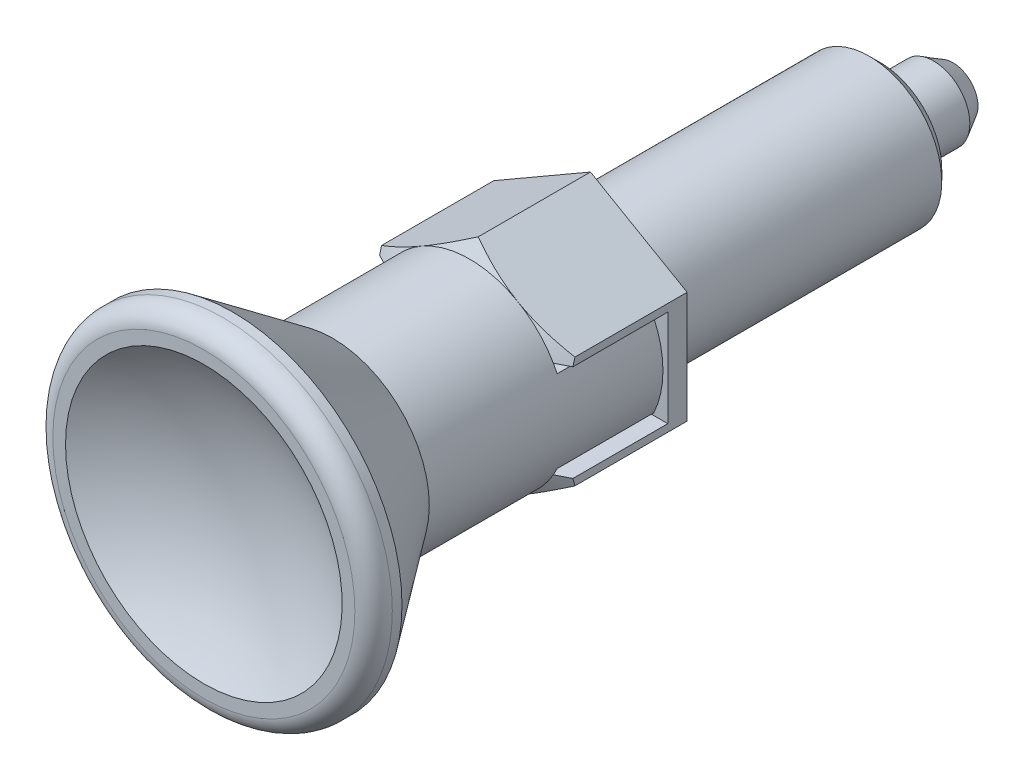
ISO-10303-21;
HEADER;
FILE_DESCRIPTION(('STEP AP214'),'2;1');
FILE_NAME('part.step','',(''),(''),'','','');
FILE_SCHEMA(('AUTOMOTIVE_DESIGN { 1 0 10303 214 1 1 1 1 }'));
ENDSEC;
DATA;
#1=APPLICATION_CONTEXT('core data for automotive mechanical design processes');
#2=APPLICATION_PROTOCOL_DEFINITION('international standard','automotive_design',2000,#1);
#3=PRODUCT_CONTEXT('',#1,'mechanical');
#4=PRODUCT('Part','Part','',(#3));
#5=PRODUCT_RELATED_PRODUCT_CATEGORY('part','',(#4));
#6=PRODUCT_DEFINITION_FORMATION('','',#4);
#7=PRODUCT_DEFINITION_CONTEXT('part definition',#1,'design');
#8=PRODUCT_DEFINITION('design','',#6,#7);
#9=PRODUCT_DEFINITION_SHAPE('','',#8);
#10=(LENGTH_UNIT() NAMED_UNIT(*) SI_UNIT(.MILLI.,.METRE.));
#11=(NAMED_UNIT(*) PLANE_ANGLE_UNIT() SI_UNIT($,.RADIAN.));
#12=(NAMED_UNIT(*) SI_UNIT($,.STERADIAN.) SOLID_ANGLE_UNIT());
#13=UNCERTAINTY_MEASURE_WITH_UNIT(LENGTH_MEASURE(1.E-05),#10,'distance_accuracy_value','');
#14=(GEOMETRIC_REPRESENTATION_CONTEXT(3) GLOBAL_UNCERTAINTY_ASSIGNED_CONTEXT((#13)) GLOBAL_UNIT_ASSIGNED_CONTEXT((#10,
#11,#12)) REPRESENTATION_CONTEXT('',''));
#15=CARTESIAN_POINT('',(0.,0.,0.));
#16=DIRECTION('',(0.,0.,1.));
#17=DIRECTION('',(1.,0.,0.));
#18=AXIS2_PLACEMENT_3D('',#15,#16,#17);
#19=CARTESIAN_POINT('',(4.,-2.3094010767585,-1.));
#20=DIRECTION('',(1.,0.,0.));
#21=DIRECTION('',(0.,1.,0.));
#22=AXIS2_PLACEMENT_3D('',#19,#20,#21);
#23=PLANE('',#22);
#24=DIRECTION('',(0.,-1.,0.));
#25=VECTOR('',#24,1.);
#26=CARTESIAN_POINT('',(4.,0.,0.8));
#27=LINE('',#26,#25);
#28=CARTESIAN_POINT('',(4.,2.,0.8));
#29=VERTEX_POINT('',#28);
#30=CARTESIAN_POINT('',(4.,-2.,0.8));
#31=VERTEX_POINT('',#30);
#32=EDGE_CURVE('E403',#29,#31,#27,.T.);
#33=ORIENTED_EDGE('',*,*,#32,.T.);
#34=DIRECTION('',(0.,0.,1.));
#35=VECTOR('',#34,1.);
#36=CARTESIAN_POINT('',(4.,-2.,-1.));
#37=LINE('',#36,#35);
#38=CARTESIAN_POINT('',(3.99999999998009,-2.,4.72741217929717));
#39=VERTEX_POINT('',#38);
#40=EDGE_CURVE('E295',#31,#39,#37,.T.);
#41=ORIENTED_EDGE('',*,*,#40,.T.);
#42=CARTESIAN_POINT('',(4.,6.31761832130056,2.9922916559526));
#43=CARTESIAN_POINT('',(4.,6.14192520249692,3.07797180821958));
#44=CARTESIAN_POINT('',(4.,5.96584084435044,3.16286285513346));
#45=CARTESIAN_POINT('',(4.,5.61268201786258,3.33062511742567));
#46=CARTESIAN_POINT('',(4.,5.4356074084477,3.4134960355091));
#47=CARTESIAN_POINT('',(4.,5.07940162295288,3.57716927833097));
#48=CARTESIAN_POINT('',(4.,4.9002645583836,3.65795883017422));
#49=CARTESIAN_POINT('',(4.,4.54060511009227,3.81638112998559));
#50=CARTESIAN_POINT('',(4.,4.36008278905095,3.89401401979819));
#51=CARTESIAN_POINT('',(4.,3.9911078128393,4.04790350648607));
#52=CARTESIAN_POINT('',(4.,3.80259647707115,4.12402014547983));
#53=CARTESIAN_POINT('',(4.,3.42341084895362,4.27076449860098));
#54=CARTESIAN_POINT('',(4.,3.23273632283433,4.34139161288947));
#55=CARTESIAN_POINT('',(4.,2.84924251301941,4.47538599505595));
#56=CARTESIAN_POINT('',(4.,2.65642808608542,4.5387670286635));
#57=CARTESIAN_POINT('',(4.,2.2680353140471,4.65631131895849));
#58=CARTESIAN_POINT('',(4.,2.07245782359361,4.71047736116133));
#59=CARTESIAN_POINT('',(4.,1.67954158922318,4.806772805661));
#60=CARTESIAN_POINT('',(4.,1.48222021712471,4.84897182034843));
#61=CARTESIAN_POINT('',(4.,1.08500777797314,4.91903453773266));
#62=CARTESIAN_POINT('',(4.,0.885116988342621,4.94689977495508));
#63=CARTESIAN_POINT('',(4.,0.486419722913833,4.98571330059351));
#64=CARTESIAN_POINT('',(4.,0.287635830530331,4.9968878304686));
#65=CARTESIAN_POINT('',(4.,-0.110173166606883,5.00197590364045));
#66=CARTESIAN_POINT('',(4.,-0.309198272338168,4.99588937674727));
#67=CARTESIAN_POINT('',(4.,-0.643785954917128,4.97158820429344));
#68=CARTESIAN_POINT('',(4.,-0.77969019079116,4.95777215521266));
#69=CARTESIAN_POINT('',(4.,-1.05057142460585,4.92289191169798));
#70=CARTESIAN_POINT('',(4.,-1.18554830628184,4.9018268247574));
#71=CARTESIAN_POINT('',(4.,-1.58887088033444,4.82885810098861));
#72=CARTESIAN_POINT('',(4.,-1.85547379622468,4.76719214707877));
#73=CARTESIAN_POINT('',(4.,-2.25427403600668,4.65940087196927));
#74=CARTESIAN_POINT('',(4.,-2.38851478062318,4.62039718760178));
#75=CARTESIAN_POINT('',(4.,-2.65569482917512,4.53812259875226));
#76=CARTESIAN_POINT('',(4.,-2.78863412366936,4.49485166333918));
#77=CARTESIAN_POINT('',(4.,-3.0532493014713,4.4047546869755));
#78=CARTESIAN_POINT('',(4.,-3.18492553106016,4.35792965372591));
#79=CARTESIAN_POINT('',(4.,-3.44717271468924,4.26129676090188));
#80=CARTESIAN_POINT('',(4.,-3.57774368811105,4.2114889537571));
#81=CARTESIAN_POINT('',(4.,-3.90838583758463,4.08171887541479));
#82=CARTESIAN_POINT('',(4.,-4.10778247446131,4.00004019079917));
#83=CARTESIAN_POINT('',(4.,-4.50466534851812,3.83215118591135));
#84=CARTESIAN_POINT('',(4.,-4.70215141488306,3.74594046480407));
#85=CARTESIAN_POINT('',(4.,-5.09560571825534,3.56998451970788));
#86=CARTESIAN_POINT('',(4.,-5.29157350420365,3.48023829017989));
#87=CARTESIAN_POINT('',(4.,-5.68222178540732,3.29798176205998));
#88=CARTESIAN_POINT('',(4.,-5.87690224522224,3.20547138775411));
#89=CARTESIAN_POINT('',(4.,-6.45989965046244,2.92441834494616));
#90=CARTESIAN_POINT('',(4.,-6.84663497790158,2.73259823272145));
#91=CARTESIAN_POINT('',(4.,-7.61714397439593,2.34330251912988));
#92=CARTESIAN_POINT('',(4.,-8.00091813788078,2.14582788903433));
#93=CARTESIAN_POINT('',(4.,-8.72975807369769,1.76604091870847));
#94=CARTESIAN_POINT('',(4.,-9.07501124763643,1.58408754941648));
#95=CARTESIAN_POINT('',(4.,-9.76427122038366,1.2177978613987));
#96=CARTESIAN_POINT('',(4.,-10.1082779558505,1.03346142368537));
#97=CARTESIAN_POINT('',(4.,-10.7942722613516,0.663568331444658));
#98=CARTESIAN_POINT('',(4.,-11.1362627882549,0.478017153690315));
#99=CARTESIAN_POINT('',(4.,-11.8194584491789,0.105530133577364));
#100=CARTESIAN_POINT('',(4.,-12.1606636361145,-0.081405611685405));
#101=CARTESIAN_POINT('',(4.,-12.5015869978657,-0.268850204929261));
#102=B_SPLINE_CURVE_WITH_KNOTS('',3,(#42,#43,#44,#45,#46,#47,#48,#49,#50,#51,#52,#53,#54,#55,
#56,#57,#58,#59,#60,#61,#62,#63,#64,#65,#66,#67,#68,#69,#70,#71,#72,#73,#74,#75,#76,#77,#78,#79,
#80,#81,#82,#83,#84,#85,#86,#87,#88,#89,#90,#91,#92,#93,#94,#95,#96,#97,#98,#99,#100,#101),
.UNSPECIFIED.,.F.,.F.,(4,2,2,2,2,2,2,2,2,2,2,2,2,2,2,2,2,2,2,2,2,2,2,2,2,2,2,2,2,4),(0.,
0.586421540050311,1.1729288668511,1.762440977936,2.35192656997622,2.96175582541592,
3.57165162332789,4.18036881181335,4.78890166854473,5.39381845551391,5.99867046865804,
6.59524689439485,7.19182574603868,7.60144321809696,8.01111114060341,8.83085062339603,
9.25018861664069,9.66952964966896,10.0887522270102,10.5079674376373,11.1543192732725,
11.8007283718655,12.4473226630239,13.0939346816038,14.3889300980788,15.6837043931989,
16.8544868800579,18.0253280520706,19.1925780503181,20.3597469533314),.UNSPECIFIED.);
#103=CARTESIAN_POINT('',(4.,-2.3094010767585,4.64273441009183));
#104=VERTEX_POINT('',#103);
#105=EDGE_CURVE('E395',#39,#104,#102,.T.);
#106=ORIENTED_EDGE('',*,*,#105,.T.);
#107=DIRECTION('',(0.,0.,1.));
#108=VECTOR('',#107,1.);
#109=CARTESIAN_POINT('',(4.,-2.3094010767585,-1.));
#110=LINE('',#109,#108);
#111=CARTESIAN_POINT('',(4.,-2.3094010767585,0.));
#112=VERTEX_POINT('',#111);
#113=EDGE_CURVE('E43',#112,#104,#110,.T.);
#114=ORIENTED_EDGE('',*,*,#113,.F.);
#115=DIRECTION('',(0.,1.,0.));
#116=VECTOR('',#115,1.);
#117=CARTESIAN_POINT('',(4.,0.,0.));
#118=LINE('',#117,#116);
#119=CARTESIAN_POINT('',(4.,2.3094010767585,0.));
#120=VERTEX_POINT('',#119);
#121=EDGE_CURVE('E405',#112,#120,#118,.T.);
#122=ORIENTED_EDGE('',*,*,#121,.T.);
#123=DIRECTION('',(0.,0.,1.));
#124=VECTOR('',#123,1.);
#125=CARTESIAN_POINT('',(4.,2.3094010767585,-1.));
#126=LINE('',#125,#124);
#127=CARTESIAN_POINT('',(4.,2.3094010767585,4.64273441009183));
#128=VERTEX_POINT('',#127);
#129=EDGE_CURVE('E574',#120,#128,#126,.T.);
#130=ORIENTED_EDGE('',*,*,#129,.T.);
#131=CARTESIAN_POINT('',(4.00000000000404,2.,4.7274121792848));
#132=VERTEX_POINT('',#131);
#133=EDGE_CURVE('E402',#128,#132,#102,.T.);
#134=ORIENTED_EDGE('',*,*,#133,.T.);
#135=DIRECTION('',(0.,0.,-1.));
#136=VECTOR('',#135,1.);
#137=CARTESIAN_POINT('',(4.,2.,-1.));
#138=LINE('',#137,#136);
#139=EDGE_CURVE('E308',#132,#29,#138,.T.);
#140=ORIENTED_EDGE('',*,*,#139,.T.);
#141=EDGE_LOOP('',(#33,#41,#106,#114,#122,#130,#134,#140));
#142=FACE_BOUND('',#141,.T.);
#143=ADVANCED_FACE('F14',(#142),#23,.T.);
#144=CARTESIAN_POINT('',(0.,0.,3.2679491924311));
#145=DIRECTION('',(0.,0.,-1.));
#146=DIRECTION('',(1.,0.,0.));
#147=AXIS2_PLACEMENT_3D('',#144,#145,#146);
#148=CONICAL_SURFACE('',#147,7.,1.0471975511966);
#149=CARTESIAN_POINT('',(6.54485852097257,2.,3.35823360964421));
#150=CARTESIAN_POINT('',(6.41788262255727,2.,3.42834117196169));
#151=CARTESIAN_POINT('',(6.29083452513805,2.,3.49831797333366));
#152=CARTESIAN_POINT('',(6.03656362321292,2.,3.63795463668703));
#153=CARTESIAN_POINT('',(5.90934081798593,2.,3.70761449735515));
#154=CARTESIAN_POINT('',(5.52745619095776,2.,3.91598570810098));
#155=CARTESIAN_POINT('',(5.27248870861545,2.,4.05413817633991));
#156=CARTESIAN_POINT('',(4.76221685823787,2.,4.3278026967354));
#157=CARTESIAN_POINT('',(4.50691635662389,2.,4.46332193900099));
#158=CARTESIAN_POINT('',(3.99444443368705,2.,4.7310559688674));
#159=CARTESIAN_POINT('',(3.73727227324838,2.,4.86326934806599));
#160=CARTESIAN_POINT('',(3.26498226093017,2.,5.09967278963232));
#161=CARTESIAN_POINT('',(3.05031018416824,2.,5.20474469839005));
#162=CARTESIAN_POINT('',(2.72618693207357,2.,5.35762602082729));
#163=CARTESIAN_POINT('',(2.61784296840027,2.,5.407777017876));
#164=CARTESIAN_POINT('',(2.40023044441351,2.,5.50602577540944));
#165=CARTESIAN_POINT('',(2.29096192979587,2.,5.55412363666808));
#166=CARTESIAN_POINT('',(2.07084539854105,2.,5.64779089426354));
#167=CARTESIAN_POINT('',(1.95999294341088,2.,5.69334993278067));
#168=CARTESIAN_POINT('',(1.73688431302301,2.,5.7807794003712));
#169=CARTESIAN_POINT('',(1.6246287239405,2.,5.82265131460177));
#170=CARTESIAN_POINT('',(1.39798153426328,2.,5.90154823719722));
#171=CARTESIAN_POINT('',(1.28358416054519,2.,5.93855698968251));
#172=CARTESIAN_POINT('',(1.11041686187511,2.,5.98897864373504));
#173=CARTESIAN_POINT('',(1.05239125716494,2.,6.00494670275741));
#174=CARTESIAN_POINT('',(0.935813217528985,2.,6.03490495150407));
#175=CARTESIAN_POINT('',(0.877260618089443,2.,6.04889449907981));
#176=CARTESIAN_POINT('',(0.818448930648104,2.,6.0617554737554));
#177=B_SPLINE_CURVE_WITH_KNOTS('',3,(#149,#150,#151,#152,#153,#154,#155,#156,#157,#158,#159,
#160,#161,#162,#163,#164,#165,#166,#167,#168,#169,#170,#171,#172,#173,#174,#175,#176),
.UNSPECIFIED.,.F.,.F.,(4,2,2,2,2,2,2,2,2,2,2,2,2,4),(0.,0.435133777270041,0.870269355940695,
1.74023383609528,2.60733687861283,3.47480324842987,4.19175065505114,4.5498994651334,
4.90803067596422,5.2675296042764,5.62688305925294,5.98740870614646,6.1679252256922,
6.34850020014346),.UNSPECIFIED.);
#178=CARTESIAN_POINT('',(3.46410161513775,2.,5.));
#179=VERTEX_POINT('',#178);
#180=EDGE_CURVE('E301',#132,#179,#177,.T.);
#181=ORIENTED_EDGE('',*,*,#180,.F.);
#182=ORIENTED_EDGE('',*,*,#133,.F.);
#183=CARTESIAN_POINT('',(-0.000200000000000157,4.61891762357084,4.64266774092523));
#184=CARTESIAN_POINT('',(0.17557915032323,4.5174314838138,4.70128212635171));
#185=CARTESIAN_POINT('',(0.352875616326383,4.41506932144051,4.75458967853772));
#186=CARTESIAN_POINT('',(0.710538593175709,4.20857250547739,4.84763832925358));
#187=CARTESIAN_POINT('',(0.890911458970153,4.10443418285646,4.88734651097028));
#188=CARTESIAN_POINT('',(1.24942181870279,3.89744813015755,4.94915778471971));
#189=CARTESIAN_POINT('',(1.42750415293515,3.79463224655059,4.97167226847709));
#190=CARTESIAN_POINT('',(1.78450671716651,3.58851671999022,4.99854937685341));
#191=CARTESIAN_POINT('',(1.9634256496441,3.48521782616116,5.00293425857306));
#192=CARTESIAN_POINT('',(2.29774284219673,3.29219970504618,4.99380992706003));
#193=CARTESIAN_POINT('',(2.45319115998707,3.20245157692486,4.982541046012));
#194=CARTESIAN_POINT('',(2.76307505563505,3.02354002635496,4.94682600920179));
#195=CARTESIAN_POINT('',(2.91750956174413,2.93437722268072,4.92236765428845));
#196=CARTESIAN_POINT('',(3.22803232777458,2.75509682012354,4.8612239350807));
#197=CARTESIAN_POINT('',(3.3840812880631,2.6650019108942,4.82427939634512));
#198=CARTESIAN_POINT('',(3.69385183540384,2.486155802,4.74042992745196));
#199=CARTESIAN_POINT('',(3.84757739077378,2.39740231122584,4.69354469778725));
#200=CARTESIAN_POINT('',(4.0002,2.30928560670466,4.64266774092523));
#201=B_SPLINE_CURVE_WITH_KNOTS('',3,(#183,#184,#185,#186,#187,#188,#189,#190,#191,#192,#193,
#194,#195,#196,#197,#198,#199,#200),.UNSPECIFIED.,.F.,.F.,(4,2,2,2,2,2,2,2,4),(0.,
0.634047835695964,1.26961969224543,1.88946157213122,2.50854226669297,3.04757825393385,
3.58711366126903,4.13861653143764,4.68903648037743),.UNSPECIFIED.);
#202=CARTESIAN_POINT('',(2.,3.46410161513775,5.));
#203=VERTEX_POINT('',#202);
#204=EDGE_CURVE('E511',#203,#128,#201,.T.);
#205=ORIENTED_EDGE('',*,*,#204,.F.);
#206=CARTESIAN_POINT('',(0.,0.,5.));
#207=DIRECTION('',(0.,0.,1.));
#208=DIRECTION('',(-1.,0.,0.));
#209=AXIS2_PLACEMENT_3D('',#206,#207,#208);
#210=CIRCLE('',#209,4.);
#211=EDGE_CURVE('E427',#179,#203,#210,.T.);
#212=ORIENTED_EDGE('',*,*,#211,.F.);
#213=EDGE_LOOP('',(#181,#182,#205,#212));
#214=FACE_BOUND('',#213,.T.);
#215=ADVANCED_FACE('F310',(#214),#148,.T.);
#216=CARTESIAN_POINT('',(0.,0.,-15.));
#217=DIRECTION('',(0.,0.,1.));
#218=DIRECTION('',(0.,-1.,0.));
#219=AXIS2_PLACEMENT_3D('',#216,#217,#218);
#220=CYLINDRICAL_SURFACE('',#219,4.);
#221=CARTESIAN_POINT('',(0.,0.,1.));
#222=DIRECTION('',(0.,0.,1.));
#223=DIRECTION('',(0.,-1.,0.));
#224=AXIS2_PLACEMENT_3D('',#221,#222,#223);
#225=CIRCLE('',#224,4.);
#226=CARTESIAN_POINT('',(-3.6207733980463,-1.7,1.));
#227=VERTEX_POINT('',#226);
#228=CARTESIAN_POINT('',(-3.6207733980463,1.7,1.));
#229=VERTEX_POINT('',#228);
#230=EDGE_CURVE('E201',#227,#229,#225,.F.);
#231=ORIENTED_EDGE('',*,*,#230,.F.);
#232=DIRECTION('',(0.,0.,1.));
#233=VECTOR('',#232,1.);
#234=CARTESIAN_POINT('',(-3.6207733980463,-1.7,0.8));
#235=LINE('',#234,#233);
#236=CARTESIAN_POINT('',(-3.6207733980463,-1.7,5.));
#237=VERTEX_POINT('',#236);
#238=EDGE_CURVE('E576',#227,#237,#235,.T.);
#239=ORIENTED_EDGE('',*,*,#238,.T.);
#240=CARTESIAN_POINT('',(-3.46410161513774,-2.,5.));
#241=VERTEX_POINT('',#240);
#242=EDGE_CURVE('E534',#237,#241,#210,.T.);
#243=ORIENTED_EDGE('',*,*,#242,.T.);
#244=CARTESIAN_POINT('',(-2.,-3.46410161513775,5.));
#245=VERTEX_POINT('',#244);
#246=EDGE_CURVE('E428',#241,#245,#210,.T.);
#247=ORIENTED_EDGE('',*,*,#246,.T.);
#248=CARTESIAN_POINT('',(2.,-3.46410161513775,5.));
#249=VERTEX_POINT('',#248);
#250=EDGE_CURVE('E535',#245,#249,#210,.T.);
#251=ORIENTED_EDGE('',*,*,#250,.T.);
#252=CARTESIAN_POINT('',(3.46410161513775,-2.,5.));
#253=VERTEX_POINT('',#252);
#254=EDGE_CURVE('E537',#249,#253,#210,.T.);
#255=ORIENTED_EDGE('',*,*,#254,.T.);
#256=CARTESIAN_POINT('',(3.62077339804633,-1.7,5.));
#257=VERTEX_POINT('',#256);
#258=EDGE_CURVE('E422',#253,#257,#210,.T.);
#259=ORIENTED_EDGE('',*,*,#258,.T.);
#260=DIRECTION('',(0.,0.,1.));
#261=VECTOR('',#260,1.);
#262=CARTESIAN_POINT('',(3.6207733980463,-1.7,0.8));
#263=LINE('',#262,#261);
#264=CARTESIAN_POINT('',(3.6207733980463,-1.7,1.));
#265=VERTEX_POINT('',#264);
#266=EDGE_CURVE('E417',#265,#257,#263,.T.);
#267=ORIENTED_EDGE('',*,*,#266,.F.);
#268=CARTESIAN_POINT('',(0.,0.,1.));
#269=DIRECTION('',(0.,0.,-1.));
#270=DIRECTION('',(0.,1.,0.));
#271=AXIS2_PLACEMENT_3D('',#268,#269,#270);
#272=CIRCLE('',#271,4.);
#273=CARTESIAN_POINT('',(3.62077339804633,1.7,1.));
#274=VERTEX_POINT('',#273);
#275=EDGE_CURVE('E298',#265,#274,#272,.F.);
#276=ORIENTED_EDGE('',*,*,#275,.T.);
#277=DIRECTION('',(0.,0.,1.));
#278=VECTOR('',#277,1.);
#279=CARTESIAN_POINT('',(3.6207733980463,1.7,0.8));
#280=LINE('',#279,#278);
#281=CARTESIAN_POINT('',(3.62077339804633,1.7,5.));
#282=VERTEX_POINT('',#281);
#283=EDGE_CURVE('E419',#274,#282,#280,.T.);
#284=ORIENTED_EDGE('',*,*,#283,.T.);
#285=EDGE_CURVE('E423',#282,#179,#210,.T.);
#286=ORIENTED_EDGE('',*,*,#285,.T.);
#287=ORIENTED_EDGE('',*,*,#211,.T.);
#288=CARTESIAN_POINT('',(-2.,3.46410161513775,5.));
#289=VERTEX_POINT('',#288);
#290=EDGE_CURVE('E429',#203,#289,#210,.T.);
#291=ORIENTED_EDGE('',*,*,#290,.T.);
#292=CARTESIAN_POINT('',(-3.46410161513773,2.,5.));
#293=VERTEX_POINT('',#292);
#294=EDGE_CURVE('E533',#289,#293,#210,.T.);
#295=ORIENTED_EDGE('',*,*,#294,.T.);
#296=CARTESIAN_POINT('',(0.,0.,5.));
#297=DIRECTION('',(0.,0.,1.));
#298=DIRECTION('',(0.,-1.,0.));
#299=AXIS2_PLACEMENT_3D('',#296,#297,#298);
#300=CIRCLE('',#299,4.);
#301=CARTESIAN_POINT('',(-3.6207733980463,1.7,5.));
#302=VERTEX_POINT('',#301);
#303=EDGE_CURVE('E241',#293,#302,#300,.T.);
#304=ORIENTED_EDGE('',*,*,#303,.T.);
#305=DIRECTION('',(0.,0.,1.));
#306=VECTOR('',#305,1.);
#307=CARTESIAN_POINT('',(-3.6207733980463,1.7,0.8));
#308=LINE('',#307,#306);
#309=EDGE_CURVE('E580',#229,#302,#308,.T.);
#310=ORIENTED_EDGE('',*,*,#309,.F.);
#311=EDGE_LOOP('',(#231,#239,#243,#247,#251,#255,#259,#267,#276,#284,#286,#287,#291,#295,#304,#310));
#312=FACE_BOUND('',#311,.T.);
#313=CARTESIAN_POINT('',(0.,0.,10.6708542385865));
#314=DIRECTION('',(0.,0.,1.));
#315=DIRECTION('',(0.,-1.,0.));
#316=AXIS2_PLACEMENT_3D('',#313,#314,#315);
#317=CIRCLE('',#316,4.);
#318=CARTESIAN_POINT('',(0.,-4.,10.6708542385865));
#319=VERTEX_POINT('',#318);
#320=EDGE_CURVE('E447',#319,#319,#317,.T.);
#321=ORIENTED_EDGE('',*,*,#320,.F.);
#322=EDGE_LOOP('',(#321));
#323=FACE_BOUND('',#322,.T.);
#324=ADVANCED_FACE('F382',(#312,#323),#220,.T.);
#325=CARTESIAN_POINT('',(0.849056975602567,-2.,6.05495594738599));
#326=CARTESIAN_POINT('',(0.945372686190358,-2.,6.03319896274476));
#327=CARTESIAN_POINT('',(1.0409659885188,-2.,6.00852205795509));
#328=CARTESIAN_POINT('',(1.23071670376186,-2.,5.95443482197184));
#329=CARTESIAN_POINT('',(1.32487537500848,-2.,5.92502893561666));
#330=CARTESIAN_POINT('',(1.51172044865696,-2.,5.86262058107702));
#331=CARTESIAN_POINT('',(1.60440984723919,-2.,5.8296269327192));
#332=CARTESIAN_POINT('',(1.78874364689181,-2.,5.7607823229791));
#333=CARTESIAN_POINT('',(1.8803877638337,-2.,5.7249306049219));
#334=CARTESIAN_POINT('',(2.06243027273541,-2.,5.65114563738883));
#335=CARTESIAN_POINT('',(2.15283203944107,-2.,5.61322066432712));
#336=CARTESIAN_POINT('',(2.33288747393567,-2.,5.53563050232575));
#337=CARTESIAN_POINT('',(2.42254110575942,-2.,5.49596523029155));
#338=CARTESIAN_POINT('',(2.69065529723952,-2.,5.37487787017));
#339=CARTESIAN_POINT('',(2.86818647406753,-2.,5.29139856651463));
#340=CARTESIAN_POINT('',(3.11829277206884,-2.,5.17069732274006));
#341=CARTESIAN_POINT('',(3.1915884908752,-2.,5.13494504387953));
#342=CARTESIAN_POINT('',(3.33794444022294,-2.,5.06289189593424));
#343=CARTESIAN_POINT('',(3.41100457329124,-2.,5.0265908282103));
#344=CARTESIAN_POINT('',(3.74540440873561,-2.,4.859164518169));
#345=CARTESIAN_POINT('',(4.00542270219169,-2.,4.72540238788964));
#346=CARTESIAN_POINT('',(4.52368706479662,-2.,4.45447482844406));
#347=CARTESIAN_POINT('',(4.78193301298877,-2.,4.31730916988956));
#348=CARTESIAN_POINT('',(5.29664045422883,-2.,4.04109781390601));
#349=CARTESIAN_POINT('',(5.55310470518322,-2.,3.90205725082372));
#350=CARTESIAN_POINT('',(5.93716911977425,-2.,3.69239189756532));
#351=CARTESIAN_POINT('',(6.06507486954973,-2.,3.6223251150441));
#352=CARTESIAN_POINT('',(6.32071175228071,-2.,3.481875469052));
#353=CARTESIAN_POINT('',(6.44844288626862,-2.,3.41149260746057));
#354=CARTESIAN_POINT('',(6.57610198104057,-2.,3.34097917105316));
#355=B_SPLINE_CURVE_WITH_KNOTS('',3,(#325,#326,#327,#328,#329,#330,#331,#332,#333,#334,#335,
#336,#337,#338,#339,#340,#341,#342,#343,#344,#345,#346,#347,#348,#349,#350,#351,#352,#353,#354),
.UNSPECIFIED.,.F.,.F.,(4,2,2,2,2,2,2,2,2,2,2,2,2,2,4),(0.,0.296093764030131,0.591910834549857,
0.887016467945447,1.18220049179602,1.47628178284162,1.77037713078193,2.35883626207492,
2.60348783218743,2.84823018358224,3.72539868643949,4.60262646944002,5.47780710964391,
5.91532614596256,6.35284258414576),.UNSPECIFIED.);
#356=EDGE_CURVE('E329',#253,#39,#355,.T.);
#357=ORIENTED_EDGE('',*,*,#356,.F.);
#358=ORIENTED_EDGE('',*,*,#254,.F.);
#359=CARTESIAN_POINT('',(4.0002,-2.30928560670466,4.64266774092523));
#360=CARTESIAN_POINT('',(3.82442084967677,-2.4107717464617,4.70128212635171));
#361=CARTESIAN_POINT('',(3.64712438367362,-2.51313390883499,4.75458967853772));
#362=CARTESIAN_POINT('',(3.28946140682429,-2.71963072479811,4.84763832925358));
#363=CARTESIAN_POINT('',(3.10908854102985,-2.82376904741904,4.88734651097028));
#364=CARTESIAN_POINT('',(2.75057818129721,-3.03075510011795,4.94915778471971));
#365=CARTESIAN_POINT('',(2.57249584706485,-3.13357098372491,4.97167226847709));
#366=CARTESIAN_POINT('',(2.21549328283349,-3.33968651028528,4.99854937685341));
#367=CARTESIAN_POINT('',(2.0365743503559,-3.44298540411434,5.00293425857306));
#368=CARTESIAN_POINT('',(1.70225715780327,-3.63600352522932,4.99380992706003));
#369=CARTESIAN_POINT('',(1.54680884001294,-3.72575165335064,4.982541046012));
#370=CARTESIAN_POINT('',(1.23692494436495,-3.90466320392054,4.94682600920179));
#371=CARTESIAN_POINT('',(1.08249043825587,-3.99382600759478,4.92236765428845));
#372=CARTESIAN_POINT('',(0.771967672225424,-4.17310641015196,4.8612239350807));
#373=CARTESIAN_POINT('',(0.6159187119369,-4.2632013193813,4.82427939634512));
#374=CARTESIAN_POINT('',(0.306148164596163,-4.4420474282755,4.74042992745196));
#375=CARTESIAN_POINT('',(0.152422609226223,-4.53080091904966,4.69354469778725));
#376=CARTESIAN_POINT('',(-0.000199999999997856,-4.61891762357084,4.64266774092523));
#377=B_SPLINE_CURVE_WITH_KNOTS('',3,(#359,#360,#361,#362,#363,#364,#365,#366,#367,#368,#369,
#370,#371,#372,#373,#374,#375,#376),.UNSPECIFIED.,.F.,.F.,(4,2,2,2,2,2,2,2,4),(0.,
0.634047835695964,1.26961969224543,1.88946157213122,2.50854226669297,3.04757825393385,
3.58711366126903,4.13861653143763,4.68903648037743),.UNSPECIFIED.);
#378=EDGE_CURVE('E462',#104,#249,#377,.T.);
#379=ORIENTED_EDGE('',*,*,#378,.F.);
#380=ORIENTED_EDGE('',*,*,#105,.F.);
#381=EDGE_LOOP('',(#357,#358,#379,#380));
#382=FACE_BOUND('',#381,.T.);
#383=ADVANCED_FACE('F384',(#382),#148,.T.);
#384=CARTESIAN_POINT('',(3.,0.,0.));
#385=DIRECTION('',(0.,0.,1.));
#386=DIRECTION('',(-1.,0.,0.));
#387=AXIS2_PLACEMENT_3D('',#384,#385,#386);
#388=PLANE('',#387);
#389=CARTESIAN_POINT('',(0.,0.,0.));
#390=DIRECTION('',(0.,0.,1.));
#391=DIRECTION('',(-1.,0.,0.));
#392=AXIS2_PLACEMENT_3D('',#389,#390,#391);
#393=CIRCLE('',#392,3.);
#394=CARTESIAN_POINT('',(-2.99999999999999,0.,0.));
#395=VERTEX_POINT('',#394);
#396=EDGE_CURVE('E426',#395,#395,#393,.T.);
#397=ORIENTED_EDGE('',*,*,#396,.T.);
#398=EDGE_LOOP('',(#397));
#399=FACE_BOUND('',#398,.T.);
#400=DIRECTION('',(-0.866025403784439,0.5,0.));
#401=VECTOR('',#400,1.);
#402=CARTESIAN_POINT('',(4.25,2.1650635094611,0.));
#403=LINE('',#402,#401);
#404=CARTESIAN_POINT('',(0.,4.618802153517,0.));
#405=VERTEX_POINT('',#404);
#406=EDGE_CURVE('E415',#120,#405,#403,.T.);
#407=ORIENTED_EDGE('',*,*,#406,.F.);
#408=ORIENTED_EDGE('',*,*,#121,.F.);
#409=DIRECTION('',(0.866025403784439,0.5,0.));
#410=VECTOR('',#409,1.);
#411=CARTESIAN_POINT('',(4.25,-2.1650635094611,0.));
#412=LINE('',#411,#410);
#413=CARTESIAN_POINT('',(0.,-4.618802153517,0.));
#414=VERTEX_POINT('',#413);
#415=EDGE_CURVE('E407',#414,#112,#412,.T.);
#416=ORIENTED_EDGE('',*,*,#415,.F.);
#417=DIRECTION('',(0.866025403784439,-0.5,0.));
#418=VECTOR('',#417,1.);
#419=CARTESIAN_POINT('',(0.250000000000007,-4.76313972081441,0.));
#420=LINE('',#419,#418);
#421=CARTESIAN_POINT('',(-4.,-2.3094010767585,0.));
#422=VERTEX_POINT('',#421);
#423=EDGE_CURVE('E409',#422,#414,#420,.T.);
#424=ORIENTED_EDGE('',*,*,#423,.F.);
#425=DIRECTION('',(0.,-1.,0.));
#426=VECTOR('',#425,1.);
#427=CARTESIAN_POINT('',(-4.,0.,0.));
#428=LINE('',#427,#426);
#429=CARTESIAN_POINT('',(-4.,2.3094010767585,0.));
#430=VERTEX_POINT('',#429);
#431=EDGE_CURVE('E411',#430,#422,#428,.T.);
#432=ORIENTED_EDGE('',*,*,#431,.F.);
#433=DIRECTION('',(-0.866025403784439,-0.5,0.));
#434=VECTOR('',#433,1.);
#435=CARTESIAN_POINT('',(0.250000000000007,4.76313972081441,0.));
#436=LINE('',#435,#434);
#437=EDGE_CURVE('E413',#405,#430,#436,.T.);
#438=ORIENTED_EDGE('',*,*,#437,.F.);
#439=EDGE_LOOP('',(#407,#408,#416,#424,#432,#438));
#440=FACE_BOUND('',#439,.T.);
#441=ADVANCED_FACE('F636',(#399,#440),#388,.F.);
#442=CARTESIAN_POINT('',(1.5,0.,-12.));
#443=DIRECTION('',(0.,0.,1.));
#444=DIRECTION('',(-1.,0.,0.));
#445=AXIS2_PLACEMENT_3D('',#442,#443,#444);
#446=PLANE('',#445);
#447=CARTESIAN_POINT('',(0.,0.,-12.));
#448=DIRECTION('',(0.,0.,1.));
#449=DIRECTION('',(-1.,0.,0.));
#450=AXIS2_PLACEMENT_3D('',#447,#448,#449);
#451=CIRCLE('',#450,2.54);
#452=CARTESIAN_POINT('',(-2.54,0.,-12.));
#453=VERTEX_POINT('',#452);
#454=EDGE_CURVE('E435',#453,#453,#451,.T.);
#455=ORIENTED_EDGE('',*,*,#454,.F.);
#456=EDGE_LOOP('',(#455));
#457=FACE_BOUND('',#456,.T.);
#458=CARTESIAN_POINT('',(0.,0.,-12.));
#459=DIRECTION('',(0.,0.,1.));
#460=DIRECTION('',(-1.,0.,0.));
#461=AXIS2_PLACEMENT_3D('',#458,#459,#460);
#462=CIRCLE('',#461,1.5);
#463=CARTESIAN_POINT('',(-1.49999999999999,0.,-12.));
#464=VERTEX_POINT('',#463);
#465=EDGE_CURVE('E438',#464,#464,#462,.T.);
#466=ORIENTED_EDGE('',*,*,#465,.T.);
#467=EDGE_LOOP('',(#466));
#468=FACE_BOUND('',#467,.T.);
#469=ADVANCED_FACE('F768',(#457,#468),#446,.F.);
#470=CARTESIAN_POINT('',(0.,0.,-12.));
#471=DIRECTION('',(0.,0.,1.));
#472=DIRECTION('',(-1.,0.,0.));
#473=AXIS2_PLACEMENT_3D('',#470,#471,#472);
#474=CONICAL_SURFACE('',#473,2.54,0.785398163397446);
#475=CARTESIAN_POINT('',(0.,0.,-11.54));
#476=DIRECTION('',(0.,0.,1.));
#477=DIRECTION('',(-1.,0.,0.));
#478=AXIS2_PLACEMENT_3D('',#475,#476,#477);
#479=CIRCLE('',#478,3.);
#480=CARTESIAN_POINT('',(-2.99999999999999,0.,-11.54));
#481=VERTEX_POINT('',#480);
#482=EDGE_CURVE('E432',#481,#481,#479,.T.);
#483=ORIENTED_EDGE('',*,*,#482,.F.);
#484=EDGE_LOOP('',(#483));
#485=FACE_BOUND('',#484,.T.);
#486=ORIENTED_EDGE('',*,*,#454,.T.);
#487=EDGE_LOOP('',(#486));
#488=FACE_BOUND('',#487,.T.);
#489=ADVANCED_FACE('F756',(#485,#488),#474,.T.);
#490=CARTESIAN_POINT('',(0.,0.,-12.));
#491=DIRECTION('',(0.,0.,1.));
#492=DIRECTION('',(-1.,0.,0.));
#493=AXIS2_PLACEMENT_3D('',#490,#491,#492);
#494=CYLINDRICAL_SURFACE('',#493,3.);
#495=ORIENTED_EDGE('',*,*,#396,.F.);
#496=EDGE_LOOP('',(#495));
#497=FACE_BOUND('',#496,.T.);
#498=ORIENTED_EDGE('',*,*,#482,.T.);
#499=EDGE_LOOP('',(#498));
#500=FACE_BOUND('',#499,.T.);
#501=ADVANCED_FACE('F746',(#497,#500),#494,.T.);
#502=CARTESIAN_POINT('',(1.0381197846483,0.,-15.));
#503=DIRECTION('',(0.,0.,-1.));
#504=DIRECTION('',(0.,1.,0.));
#505=AXIS2_PLACEMENT_3D('',#502,#503,#504);
#506=PLANE('',#505);
#507=CARTESIAN_POINT('',(0.,0.,-15.));
#508=DIRECTION('',(0.,0.,1.));
#509=DIRECTION('',(0.,-1.,0.));
#510=AXIS2_PLACEMENT_3D('',#507,#508,#509);
#511=CIRCLE('',#510,1.0381197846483);
#512=CARTESIAN_POINT('',(0.,-1.0381197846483,-15.));
#513=VERTEX_POINT('',#512);
#514=EDGE_CURVE('E441',#513,#513,#511,.T.);
#515=ORIENTED_EDGE('',*,*,#514,.F.);
#516=EDGE_LOOP('',(#515));
#517=FACE_BOUND('',#516,.T.);
#518=ADVANCED_FACE('F737',(#517),#506,.T.);
#519=CARTESIAN_POINT('',(0.,0.,-14.2));
#520=DIRECTION('',(0.,0.,1.));
#521=DIRECTION('',(0.,-1.,0.));
#522=AXIS2_PLACEMENT_3D('',#519,#520,#521);
#523=CONICAL_SURFACE('',#522,1.5,0.523598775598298);
#524=ORIENTED_EDGE('',*,*,#514,.T.);
#525=EDGE_LOOP('',(#524));
#526=FACE_BOUND('',#525,.T.);
#527=CARTESIAN_POINT('',(0.,0.,-14.2));
#528=DIRECTION('',(0.,0.,1.));
#529=DIRECTION('',(0.,-1.,0.));
#530=AXIS2_PLACEMENT_3D('',#527,#528,#529);
#531=CIRCLE('',#530,1.5);
#532=CARTESIAN_POINT('',(0.,-1.5,-14.2));
#533=VERTEX_POINT('',#532);
#534=EDGE_CURVE('E444',#533,#533,#531,.T.);
#535=ORIENTED_EDGE('',*,*,#534,.F.);
#536=EDGE_LOOP('',(#535));
#537=FACE_BOUND('',#536,.T.);
#538=ADVANCED_FACE('F729',(#526,#537),#523,.T.);
#539=CARTESIAN_POINT('',(0.,0.,-15.));
#540=DIRECTION('',(0.,0.,1.));
#541=DIRECTION('',(0.,-1.,0.));
#542=AXIS2_PLACEMENT_3D('',#539,#540,#541);
#543=CYLINDRICAL_SURFACE('',#542,1.5);
#544=ORIENTED_EDGE('',*,*,#534,.T.);
#545=EDGE_LOOP('',(#544));
#546=FACE_BOUND('',#545,.T.);
#547=ORIENTED_EDGE('',*,*,#465,.F.);
#548=EDGE_LOOP('',(#547));
#549=FACE_BOUND('',#548,.T.);
#550=ADVANCED_FACE('F722',(#546,#549),#543,.T.);
#551=CARTESIAN_POINT('',(4.,2.3094010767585,-1.));
#552=DIRECTION('',(0.5,0.866025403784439,0.));
#553=DIRECTION('',(-0.866025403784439,0.5,0.));
#554=AXIS2_PLACEMENT_3D('',#551,#552,#553);
#555=PLANE('',#554);
#556=ORIENTED_EDGE('',*,*,#406,.T.);
#557=DIRECTION('',(0.,0.,1.));
#558=VECTOR('',#557,1.);
#559=CARTESIAN_POINT('',(0.,4.618802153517,-1.));
#560=LINE('',#559,#558);
#561=CARTESIAN_POINT('',(0.,4.618802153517,4.64273441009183));
#562=VERTEX_POINT('',#561);
#563=EDGE_CURVE('E518',#405,#562,#560,.T.);
#564=ORIENTED_EDGE('',*,*,#563,.T.);
#565=EDGE_CURVE('E505',#562,#203,#201,.T.);
#566=ORIENTED_EDGE('',*,*,#565,.T.);
#567=ORIENTED_EDGE('',*,*,#204,.T.);
#568=ORIENTED_EDGE('',*,*,#129,.F.);
#569=EDGE_LOOP('',(#556,#564,#566,#567,#568));
#570=FACE_BOUND('',#569,.T.);
#571=ADVANCED_FACE('F392',(#570),#555,.T.);
#572=CARTESIAN_POINT('',(0.,4.618802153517,-1.));
#573=DIRECTION('',(-0.5,0.866025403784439,0.));
#574=DIRECTION('',(-0.866025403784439,-0.5,0.));
#575=AXIS2_PLACEMENT_3D('',#572,#573,#574);
#576=PLANE('',#575);
#577=ORIENTED_EDGE('',*,*,#437,.T.);
#578=DIRECTION('',(0.,0.,1.));
#579=VECTOR('',#578,1.);
#580=CARTESIAN_POINT('',(-4.,2.3094010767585,-1.));
#581=LINE('',#580,#579);
#582=CARTESIAN_POINT('',(-4.,2.3094010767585,4.64273441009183));
#583=VERTEX_POINT('',#582);
#584=EDGE_CURVE('E527',#430,#583,#581,.T.);
#585=ORIENTED_EDGE('',*,*,#584,.T.);
#586=CARTESIAN_POINT('',(-4.0002,2.30928560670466,4.64266774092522));
#587=CARTESIAN_POINT('',(-3.82442084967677,2.4107717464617,4.7012821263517));
#588=CARTESIAN_POINT('',(-3.64712438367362,2.51313390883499,4.75458967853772));
#589=CARTESIAN_POINT('',(-3.28946140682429,2.71963072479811,4.84763832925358));
#590=CARTESIAN_POINT('',(-3.10908854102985,2.82376904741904,4.88734651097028));
#591=CARTESIAN_POINT('',(-2.75057818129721,3.03075510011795,4.9491577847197));
#592=CARTESIAN_POINT('',(-2.57249584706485,3.13357098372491,4.97167226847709));
#593=CARTESIAN_POINT('',(-2.21549328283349,3.33968651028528,4.99854937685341));
#594=CARTESIAN_POINT('',(-2.03657435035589,3.44298540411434,5.00293425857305));
#595=CARTESIAN_POINT('',(-1.70225715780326,3.63600352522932,4.99380992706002));
#596=CARTESIAN_POINT('',(-1.54680884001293,3.72575165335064,4.98254104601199));
#597=CARTESIAN_POINT('',(-1.23692494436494,3.90466320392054,4.94682600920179));
#598=CARTESIAN_POINT('',(-1.08249043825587,3.99382600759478,4.92236765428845));
#599=CARTESIAN_POINT('',(-0.771967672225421,4.17310641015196,4.8612239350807));
#600=CARTESIAN_POINT('',(-0.615918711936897,4.2632013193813,4.82427939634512));
#601=CARTESIAN_POINT('',(-0.30614816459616,4.4420474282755,4.74042992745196));
#602=CARTESIAN_POINT('',(-0.152422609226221,4.53080091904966,4.69354469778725));
#603=CARTESIAN_POINT('',(0.000199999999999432,4.61891762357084,4.64266774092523));
#604=B_SPLINE_CURVE_WITH_KNOTS('',3,(#586,#587,#588,#589,#590,#591,#592,#593,#594,#595,#596,
#597,#598,#599,#600,#601,#602,#603),.UNSPECIFIED.,.F.,.F.,(4,2,2,2,2,2,2,2,4),(0.,
0.634047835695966,1.26961969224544,1.88946157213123,2.50854226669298,3.04757825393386,
3.58711366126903,4.13861653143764,4.68903648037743),.UNSPECIFIED.);
#605=EDGE_CURVE('E498',#583,#289,#604,.T.);
#606=ORIENTED_EDGE('',*,*,#605,.T.);
#607=EDGE_CURVE('E503',#289,#562,#604,.T.);
#608=ORIENTED_EDGE('',*,*,#607,.T.);
#609=ORIENTED_EDGE('',*,*,#563,.F.);
#610=EDGE_LOOP('',(#577,#585,#606,#608,#609));
#611=FACE_BOUND('',#610,.T.);
#612=ADVANCED_FACE('F492',(#611),#576,.T.);
#613=CARTESIAN_POINT('',(-4.,2.3094010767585,-1.));
#614=DIRECTION('',(-1.,0.,0.));
#615=DIRECTION('',(0.,-1.,0.));
#616=AXIS2_PLACEMENT_3D('',#613,#614,#615);
#617=PLANE('',#616);
#618=DIRECTION('',(0.,0.,1.));
#619=VECTOR('',#618,1.);
#620=CARTESIAN_POINT('',(-4.,-2.,-1.));
#621=LINE('',#620,#619);
#622=CARTESIAN_POINT('',(-4.,-2.,0.8));
#623=VERTEX_POINT('',#622);
#624=CARTESIAN_POINT('',(-3.99999999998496,-2.,4.72741217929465));
#625=VERTEX_POINT('',#624);
#626=EDGE_CURVE('E247',#623,#625,#621,.T.);
#627=ORIENTED_EDGE('',*,*,#626,.F.);
#628=DIRECTION('',(0.,-1.,0.));
#629=VECTOR('',#628,1.);
#630=CARTESIAN_POINT('',(-4.,2.3094010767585,0.8));
#631=LINE('',#630,#629);
#632=CARTESIAN_POINT('',(-4.,2.,0.8));
#633=VERTEX_POINT('',#632);
#634=EDGE_CURVE('E335',#633,#623,#631,.T.);
#635=ORIENTED_EDGE('',*,*,#634,.F.);
#636=DIRECTION('',(0.,0.,-1.));
#637=VECTOR('',#636,1.);
#638=CARTESIAN_POINT('',(-4.,2.,-1.));
#639=LINE('',#638,#637);
#640=CARTESIAN_POINT('',(-3.99999999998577,2.,4.72741217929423));
#641=VERTEX_POINT('',#640);
#642=EDGE_CURVE('E244',#641,#633,#639,.T.);
#643=ORIENTED_EDGE('',*,*,#642,.F.);
#644=CARTESIAN_POINT('',(-4.,6.31761832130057,2.9922916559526));
#645=CARTESIAN_POINT('',(-4.,6.14192520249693,3.07797180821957));
#646=CARTESIAN_POINT('',(-4.,5.96584084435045,3.16286285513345));
#647=CARTESIAN_POINT('',(-4.,5.61268201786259,3.33062511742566));
#648=CARTESIAN_POINT('',(-4.,5.4356074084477,3.4134960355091));
#649=CARTESIAN_POINT('',(-4.,5.07940162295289,3.57716927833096));
#650=CARTESIAN_POINT('',(-4.,4.9002645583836,3.65795883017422));
#651=CARTESIAN_POINT('',(-4.,4.54060511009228,3.81638112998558));
#652=CARTESIAN_POINT('',(-4.,4.36008278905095,3.89401401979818));
#653=CARTESIAN_POINT('',(-4.,3.9911078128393,4.04790350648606));
#654=CARTESIAN_POINT('',(-4.,3.80259647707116,4.12402014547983));
#655=CARTESIAN_POINT('',(-4.,3.42341084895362,4.27076449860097));
#656=CARTESIAN_POINT('',(-4.,3.23273632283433,4.34139161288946));
#657=CARTESIAN_POINT('',(-4.,2.84924251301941,4.47538599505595));
#658=CARTESIAN_POINT('',(-4.,2.65642808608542,4.5387670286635));
#659=CARTESIAN_POINT('',(-4.,2.2680353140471,4.65631131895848));
#660=CARTESIAN_POINT('',(-4.,2.07245782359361,4.71047736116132));
#661=CARTESIAN_POINT('',(-4.,1.67954158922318,4.80677280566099));
#662=CARTESIAN_POINT('',(-4.,1.48222021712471,4.84897182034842));
#663=CARTESIAN_POINT('',(-4.,1.08500777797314,4.91903453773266));
#664=CARTESIAN_POINT('',(-4.,0.885116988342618,4.94689977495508));
#665=CARTESIAN_POINT('',(-4.,0.48641972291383,4.9857133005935));
#666=CARTESIAN_POINT('',(-4.,0.287635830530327,4.9968878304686));
#667=CARTESIAN_POINT('',(-4.,-0.110173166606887,5.00197590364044));
#668=CARTESIAN_POINT('',(-4.,-0.309198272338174,4.99588937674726));
#669=CARTESIAN_POINT('',(-4.,-0.643785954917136,4.97158820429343));
#670=CARTESIAN_POINT('',(-4.,-0.77969019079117,4.95777215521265));
#671=CARTESIAN_POINT('',(-4.,-1.05057142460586,4.92289191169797));
#672=CARTESIAN_POINT('',(-4.,-1.18554830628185,4.90182682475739));
#673=CARTESIAN_POINT('',(-4.,-1.58887088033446,4.82885810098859));
#674=CARTESIAN_POINT('',(-4.,-1.8554737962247,4.76719214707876));
#675=CARTESIAN_POINT('',(-4.,-2.2542740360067,4.65940087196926));
#676=CARTESIAN_POINT('',(-4.,-2.38851478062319,4.62039718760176));
#677=CARTESIAN_POINT('',(-4.,-2.65569482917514,4.53812259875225));
#678=CARTESIAN_POINT('',(-4.,-2.78863412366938,4.49485166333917));
#679=CARTESIAN_POINT('',(-4.,-3.05324930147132,4.40475468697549));
#680=CARTESIAN_POINT('',(-4.,-3.18492553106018,4.35792965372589));
#681=CARTESIAN_POINT('',(-4.,-3.44717271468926,4.26129676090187));
#682=CARTESIAN_POINT('',(-4.,-3.57774368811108,4.21148895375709));
#683=CARTESIAN_POINT('',(-4.,-3.90838583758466,4.08171887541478));
#684=CARTESIAN_POINT('',(-4.,-4.10778247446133,4.00004019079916));
#685=CARTESIAN_POINT('',(-4.,-4.50466534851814,3.83215118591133));
#686=CARTESIAN_POINT('',(-4.,-4.70215141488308,3.74594046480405));
#687=CARTESIAN_POINT('',(-4.,-5.09560571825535,3.56998451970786));
#688=CARTESIAN_POINT('',(-4.,-5.29157350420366,3.48023829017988));
#689=CARTESIAN_POINT('',(-4.,-5.68222178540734,3.29798176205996));
#690=CARTESIAN_POINT('',(-4.,-5.87690224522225,3.2054713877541));
#691=CARTESIAN_POINT('',(-4.,-6.45989965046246,2.92441834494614));
#692=CARTESIAN_POINT('',(-4.,-6.84663497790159,2.73259823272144));
#693=CARTESIAN_POINT('',(-4.,-7.61714397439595,2.34330251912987));
#694=CARTESIAN_POINT('',(-4.,-8.00091813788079,2.14582788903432));
#695=CARTESIAN_POINT('',(-4.,-8.72975807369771,1.76604091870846));
#696=CARTESIAN_POINT('',(-4.,-9.07501124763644,1.58408754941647));
#697=CARTESIAN_POINT('',(-4.,-9.76427122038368,1.21779786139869));
#698=CARTESIAN_POINT('',(-4.,-10.1082779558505,1.03346142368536));
#699=CARTESIAN_POINT('',(-4.,-10.7942722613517,0.663568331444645));
#700=CARTESIAN_POINT('',(-4.,-11.1362627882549,0.478017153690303));
#701=CARTESIAN_POINT('',(-4.,-11.8194584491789,0.105530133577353));
#702=CARTESIAN_POINT('',(-4.,-12.1606636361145,-0.0814056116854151));
#703=CARTESIAN_POINT('',(-4.,-12.5015869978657,-0.26885020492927));
#704=B_SPLINE_CURVE_WITH_KNOTS('',3,(#644,#645,#646,#647,#648,#649,#650,#651,#652,#653,#654,
#655,#656,#657,#658,#659,#660,#661,#662,#663,#664,#665,#666,#667,#668,#669,#670,#671,#672,#673,
#674,#675,#676,#677,#678,#679,#680,#681,#682,#683,#684,#685,#686,#687,#688,#689,#690,#691,#692,
#693,#694,#695,#696,#697,#698,#699,#700,#701,#702,#703),.UNSPECIFIED.,.F.,.F.,(4,2,2,2,2,2,2,2,
2,2,2,2,2,2,2,2,2,2,2,2,2,2,2,2,2,2,2,2,2,4),(0.,0.586421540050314,1.1729288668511,
1.76244097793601,2.35192656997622,2.96175582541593,3.5716516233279,4.18036881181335,
4.78890166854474,5.39381845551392,5.99867046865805,6.59524689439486,7.1918257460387,
7.60144321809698,8.01111114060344,8.83085062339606,9.25018861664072,9.66952964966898,
10.0887522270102,10.5079674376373,11.1543192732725,11.8007283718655,12.447322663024,
13.0939346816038,14.3889300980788,15.6837043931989,16.8544868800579,18.0253280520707,
19.1925780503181,20.3597469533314),.UNSPECIFIED.);
#705=EDGE_CURVE('E504',#641,#583,#704,.F.);
#706=ORIENTED_EDGE('',*,*,#705,.T.);
#707=ORIENTED_EDGE('',*,*,#584,.F.);
#708=ORIENTED_EDGE('',*,*,#431,.T.);
#709=DIRECTION('',(0.,0.,1.));
#710=VECTOR('',#709,1.);
#711=CARTESIAN_POINT('',(-4.,-2.3094010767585,-1.));
#712=LINE('',#711,#710);
#713=CARTESIAN_POINT('',(-4.,-2.3094010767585,4.64273441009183));
#714=VERTEX_POINT('',#713);
#715=EDGE_CURVE('E585',#422,#714,#712,.T.);
#716=ORIENTED_EDGE('',*,*,#715,.T.);
#717=EDGE_CURVE('E477',#714,#625,#704,.F.);
#718=ORIENTED_EDGE('',*,*,#717,.T.);
#719=EDGE_LOOP('',(#627,#635,#643,#706,#707,#708,#716,#718));
#720=FACE_BOUND('',#719,.T.);
#721=ADVANCED_FACE('F487',(#720),#617,.T.);
#722=CARTESIAN_POINT('',(-4.,-2.3094010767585,-1.));
#723=DIRECTION('',(-0.5,-0.866025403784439,0.));
#724=DIRECTION('',(0.866025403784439,-0.5,0.));
#725=AXIS2_PLACEMENT_3D('',#722,#723,#724);
#726=PLANE('',#725);
#727=ORIENTED_EDGE('',*,*,#423,.T.);
#728=DIRECTION('',(0.,0.,1.));
#729=VECTOR('',#728,1.);
#730=CARTESIAN_POINT('',(0.,-4.618802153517,-1.));
#731=LINE('',#730,#729);
#732=CARTESIAN_POINT('',(0.,-4.618802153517,4.64273441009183));
#733=VERTEX_POINT('',#732);
#734=EDGE_CURVE('E577',#414,#733,#731,.T.);
#735=ORIENTED_EDGE('',*,*,#734,.T.);
#736=CARTESIAN_POINT('',(0.000200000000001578,-4.61891762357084,4.64266774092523));
#737=CARTESIAN_POINT('',(-0.175579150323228,-4.5174314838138,4.70128212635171));
#738=CARTESIAN_POINT('',(-0.352875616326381,-4.41506932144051,4.75458967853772));
#739=CARTESIAN_POINT('',(-0.710538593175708,-4.20857250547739,4.84763832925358));
#740=CARTESIAN_POINT('',(-0.890911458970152,-4.10443418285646,4.88734651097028));
#741=CARTESIAN_POINT('',(-1.24942181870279,-3.89744813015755,4.9491577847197));
#742=CARTESIAN_POINT('',(-1.42750415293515,-3.79463224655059,4.97167226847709));
#743=CARTESIAN_POINT('',(-1.78450671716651,-3.58851671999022,4.9985493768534));
#744=CARTESIAN_POINT('',(-1.9634256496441,-3.48521782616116,5.00293425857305));
#745=CARTESIAN_POINT('',(-2.29774284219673,-3.29219970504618,4.99380992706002));
#746=CARTESIAN_POINT('',(-2.45319115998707,-3.20245157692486,4.98254104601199));
#747=CARTESIAN_POINT('',(-2.76307505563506,-3.02354002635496,4.94682600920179));
#748=CARTESIAN_POINT('',(-2.91750956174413,-2.93437722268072,4.92236765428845));
#749=CARTESIAN_POINT('',(-3.22803232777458,-2.75509682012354,4.86122393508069));
#750=CARTESIAN_POINT('',(-3.3840812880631,-2.6650019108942,4.82427939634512));
#751=CARTESIAN_POINT('',(-3.69385183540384,-2.486155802,4.74042992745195));
#752=CARTESIAN_POINT('',(-3.84757739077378,-2.39740231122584,4.69354469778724));
#753=CARTESIAN_POINT('',(-4.0002,-2.30928560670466,4.64266774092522));
#754=B_SPLINE_CURVE_WITH_KNOTS('',3,(#736,#737,#738,#739,#740,#741,#742,#743,#744,#745,#746,
#747,#748,#749,#750,#751,#752,#753),.UNSPECIFIED.,.F.,.F.,(4,2,2,2,2,2,2,2,4),(0.,
0.634047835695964,1.26961969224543,1.88946157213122,2.50854226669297,3.04757825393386,
3.58711366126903,4.13861653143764,4.68903648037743),.UNSPECIFIED.);
#755=EDGE_CURVE('E469',#733,#245,#754,.T.);
#756=ORIENTED_EDGE('',*,*,#755,.T.);
#757=EDGE_CURVE('E476',#245,#714,#754,.T.);
#758=ORIENTED_EDGE('',*,*,#757,.T.);
#759=ORIENTED_EDGE('',*,*,#715,.F.);
#760=EDGE_LOOP('',(#727,#735,#756,#758,#759));
#761=FACE_BOUND('',#760,.T.);
#762=ADVANCED_FACE('F484',(#761),#726,.T.);
#763=CARTESIAN_POINT('',(0.,-4.618802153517,-1.));
#764=DIRECTION('',(0.5,-0.866025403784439,0.));
#765=DIRECTION('',(0.866025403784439,0.5,0.));
#766=AXIS2_PLACEMENT_3D('',#763,#764,#765);
#767=PLANE('',#766);
#768=ORIENTED_EDGE('',*,*,#415,.T.);
#769=ORIENTED_EDGE('',*,*,#113,.T.);
#770=ORIENTED_EDGE('',*,*,#378,.T.);
#771=EDGE_CURVE('E468',#249,#733,#377,.T.);
#772=ORIENTED_EDGE('',*,*,#771,.T.);
#773=ORIENTED_EDGE('',*,*,#734,.F.);
#774=EDGE_LOOP('',(#768,#769,#770,#772,#773));
#775=FACE_BOUND('',#774,.T.);
#776=ADVANCED_FACE('F389',(#775),#767,.T.);
#777=CARTESIAN_POINT('',(2.42704467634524E-13,0.,24.1999999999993));
#778=DIRECTION('',(0.,0.,1.));
#779=DIRECTION('',(-1.,0.,0.));
#780=AXIS2_PLACEMENT_3D('',#777,#778,#779);
#781=SPHERICAL_SURFACE('',#780,9.99999999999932);
#782=CARTESIAN_POINT('',(0.,0.,16.));
#783=DIRECTION('',(0.,0.,1.));
#784=DIRECTION('',(0.,-1.,0.));
#785=AXIS2_PLACEMENT_3D('',#782,#783,#784);
#786=CIRCLE('',#785,5.7236352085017);
#787=CARTESIAN_POINT('',(0.,-5.7236352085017,16.));
#788=VERTEX_POINT('',#787);
#789=EDGE_CURVE('E459',#788,#788,#786,.T.);
#790=ORIENTED_EDGE('',*,*,#789,.T.);
#791=EDGE_LOOP('',(#790));
#792=FACE_BOUND('',#791,.T.);
#793=ADVANCED_FACE('F16',(#792),#781,.F.);
#794=CARTESIAN_POINT('',(5.7236352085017,0.,16.));
#795=DIRECTION('',(0.,0.,1.));
#796=DIRECTION('',(0.,-1.,0.));
#797=AXIS2_PLACEMENT_3D('',#794,#795,#796);
#798=PLANE('',#797);
#799=CARTESIAN_POINT('',(0.,0.,16.));
#800=DIRECTION('',(0.,0.,1.));
#801=DIRECTION('',(0.,-1.,0.));
#802=AXIS2_PLACEMENT_3D('',#799,#800,#801);
#803=CIRCLE('',#802,6.25);
#804=CARTESIAN_POINT('',(0.,-6.25,16.));
#805=VERTEX_POINT('',#804);
#806=EDGE_CURVE('E456',#805,#805,#803,.T.);
#807=ORIENTED_EDGE('',*,*,#806,.T.);
#808=EDGE_LOOP('',(#807));
#809=FACE_BOUND('',#808,.T.);
#810=ORIENTED_EDGE('',*,*,#789,.F.);
#811=EDGE_LOOP('',(#810));
#812=FACE_BOUND('',#811,.T.);
#813=ADVANCED_FACE('F676',(#809,#812),#798,.T.);
#814=CARTESIAN_POINT('',(0.,0.,15.2015639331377));
#815=DIRECTION('',(0.,0.,1.));
#816=DIRECTION('',(0.,-1.,0.));
#817=AXIS2_PLACEMENT_3D('',#814,#815,#816);
#818=TOROIDAL_SURFACE('',#817,6.20000152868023,0.800000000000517);
#819=CARTESIAN_POINT('',(0.,0.,15.2));
#820=DIRECTION('',(0.,0.,1.));
#821=DIRECTION('',(0.,-1.,0.));
#822=AXIS2_PLACEMENT_3D('',#819,#820,#821);
#823=CIRCLE('',#822,7.);
#824=CARTESIAN_POINT('',(0.,-7.,15.2));
#825=VERTEX_POINT('',#824);
#826=EDGE_CURVE('E453',#825,#825,#823,.T.);
#827=ORIENTED_EDGE('',*,*,#826,.T.);
#828=EDGE_LOOP('',(#827));
#829=FACE_BOUND('',#828,.T.);
#830=ORIENTED_EDGE('',*,*,#806,.F.);
#831=EDGE_LOOP('',(#830));
#832=FACE_BOUND('',#831,.T.);
#833=ADVANCED_FACE('F668',(#829,#832),#818,.T.);
#834=CARTESIAN_POINT('',(0.,0.,-15.));
#835=DIRECTION('',(0.,0.,1.));
#836=DIRECTION('',(0.,-1.,0.));
#837=AXIS2_PLACEMENT_3D('',#834,#835,#836);
#838=CYLINDRICAL_SURFACE('',#837,7.);
#839=CARTESIAN_POINT('',(0.,0.,14.8));
#840=DIRECTION('',(0.,0.,1.));
#841=DIRECTION('',(0.,-1.,0.));
#842=AXIS2_PLACEMENT_3D('',#839,#840,#841);
#843=CIRCLE('',#842,7.);
#844=CARTESIAN_POINT('',(0.,-7.,14.8));
#845=VERTEX_POINT('',#844);
#846=EDGE_CURVE('E450',#845,#845,#843,.T.);
#847=ORIENTED_EDGE('',*,*,#846,.T.);
#848=EDGE_LOOP('',(#847));
#849=FACE_BOUND('',#848,.T.);
#850=ORIENTED_EDGE('',*,*,#826,.F.);
#851=EDGE_LOOP('',(#850));
#852=FACE_BOUND('',#851,.T.);
#853=ADVANCED_FACE('F661',(#849,#852),#838,.T.);
#854=CARTESIAN_POINT('',(0.,0.,14.8));
#855=DIRECTION('',(0.,0.,1.));
#856=DIRECTION('',(0.,-1.,0.));
#857=AXIS2_PLACEMENT_3D('',#854,#855,#856);
#858=CONICAL_SURFACE('',#857,7.,0.628318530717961);
#859=ORIENTED_EDGE('',*,*,#320,.T.);
#860=EDGE_LOOP('',(#859));
#861=FACE_BOUND('',#860,.T.);
#862=ORIENTED_EDGE('',*,*,#846,.F.);
#863=EDGE_LOOP('',(#862));
#864=FACE_BOUND('',#863,.T.);
#865=ADVANCED_FACE('F656',(#861,#864),#858,.T.);
#866=ORIENTED_EDGE('',*,*,#755,.F.);
#867=ORIENTED_EDGE('',*,*,#771,.F.);
#868=ORIENTED_EDGE('',*,*,#250,.F.);
#869=EDGE_LOOP('',(#866,#867,#868));
#870=FACE_BOUND('',#869,.T.);
#871=ADVANCED_FACE('F385',(#870),#148,.T.);
#872=ORIENTED_EDGE('',*,*,#246,.F.);
#873=CARTESIAN_POINT('',(-0.551900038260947,-2.,6.11154275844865));
#874=CARTESIAN_POINT('',(-0.630837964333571,-2.,6.09942520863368));
#875=CARTESIAN_POINT('',(-0.70937414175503,-2.,6.08493908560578));
#876=CARTESIAN_POINT('',(-0.865520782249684,-2.,6.05190859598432));
#877=CARTESIAN_POINT('',(-0.943132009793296,-2.,6.03336786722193));
#878=CARTESIAN_POINT('',(-1.09720218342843,-2.,5.99294747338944));
#879=CARTESIAN_POINT('',(-1.17366401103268,-2.,5.97107862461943));
#880=CARTESIAN_POINT('',(-1.32574717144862,-2.,5.92454791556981));
#881=CARTESIAN_POINT('',(-1.4013682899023,-2.,5.89988536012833));
#882=CARTESIAN_POINT('',(-1.62615838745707,-2.,5.82281171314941));
#883=CARTESIAN_POINT('',(-1.77417825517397,-2.,5.76705852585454));
#884=CARTESIAN_POINT('',(-2.06792620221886,-2.,5.64956901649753));
#885=CARTESIAN_POINT('',(-2.21365207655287,-2.,5.58782730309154));
#886=CARTESIAN_POINT('',(-2.48022872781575,-2.,5.47043727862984));
#887=CARTESIAN_POINT('',(-2.60134383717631,-2.,5.41538523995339));
#888=CARTESIAN_POINT('',(-2.84253797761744,-2.,5.30316695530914));
#889=CARTESIAN_POINT('',(-2.96261733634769,-2.,5.24600141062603));
#890=CARTESIAN_POINT('',(-3.20230266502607,-2.,5.12991498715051));
#891=CARTESIAN_POINT('',(-3.32190663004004,-2.,5.07098998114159));
#892=CARTESIAN_POINT('',(-3.56049280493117,-2.,4.95189289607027));
#893=CARTESIAN_POINT('',(-3.67947500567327,-2.,4.89172079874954));
#894=CARTESIAN_POINT('',(-4.05684738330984,-2.,4.69895070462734));
#895=CARTESIAN_POINT('',(-4.31431654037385,-2.,4.56455154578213));
#896=CARTESIAN_POINT('',(-4.82776611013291,-2.,4.29295228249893));
#897=CARTESIAN_POINT('',(-5.0837465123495,-2.,4.15575215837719));
#898=CARTESIAN_POINT('',(-5.59313988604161,-2.,3.88034782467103));
#899=CARTESIAN_POINT('',(-5.84655897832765,-2.,3.74215491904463));
#900=CARTESIAN_POINT('',(-6.35266222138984,-2.,3.4644726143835));
#901=CARTESIAN_POINT('',(-6.60534642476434,-2.,3.32498331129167));
#902=CARTESIAN_POINT('',(-6.85780915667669,-2.,3.18510128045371));
#903=B_SPLINE_CURVE_WITH_KNOTS('',3,(#873,#874,#875,#876,#877,#878,#879,#880,#881,#882,#883,
#884,#885,#886,#887,#888,#889,#890,#891,#892,#893,#894,#895,#896,#897,#898,#899,#900,#901,#902),
.UNSPECIFIED.,.F.,.F.,(4,2,2,2,2,2,2,2,2,2,2,2,2,2,4),(0.,0.239497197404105,0.478780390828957,
0.717301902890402,0.955882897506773,1.4301734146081,1.90489496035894,2.30398765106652,
2.70294908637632,3.10293410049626,3.50292497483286,4.37420136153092,5.24548387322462,
6.1114275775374,6.97730769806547),.UNSPECIFIED.);
#904=EDGE_CURVE('E9',#241,#625,#903,.T.);
#905=ORIENTED_EDGE('',*,*,#904,.T.);
#906=ORIENTED_EDGE('',*,*,#717,.F.);
#907=ORIENTED_EDGE('',*,*,#757,.F.);
#908=EDGE_LOOP('',(#872,#905,#906,#907));
#909=FACE_BOUND('',#908,.T.);
#910=ADVANCED_FACE('F630',(#909),#148,.T.);
#911=ORIENTED_EDGE('',*,*,#705,.F.);
#912=CARTESIAN_POINT('',(-6.8891297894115,2.,3.16773839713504));
#913=CARTESIAN_POINT('',(-6.63317335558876,2.,3.30960528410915));
#914=CARTESIAN_POINT('',(-6.37699305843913,2.,3.45107548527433));
#915=CARTESIAN_POINT('',(-5.86407428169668,2.,3.73259093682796));
#916=CARTESIAN_POINT('',(-5.60733629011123,2.,3.87263707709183));
#917=CARTESIAN_POINT('',(-5.09378715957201,2.,4.15035725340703));
#918=CARTESIAN_POINT('',(-4.83697969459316,2.,4.28803807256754));
#919=CARTESIAN_POINT('',(-4.3216929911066,2.,4.56068940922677));
#920=CARTESIAN_POINT('',(-4.06321271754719,2.,4.6956579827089));
#921=CARTESIAN_POINT('',(-3.67287450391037,2.,4.89511230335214));
#922=CARTESIAN_POINT('',(-3.54189210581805,2.,4.96130916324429));
#923=CARTESIAN_POINT('',(-3.27916816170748,2.,5.09215754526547));
#924=CARTESIAN_POINT('',(-3.14742667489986,2.,5.15680918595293));
#925=CARTESIAN_POINT('',(-2.88317593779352,2.,5.28394845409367));
#926=CARTESIAN_POINT('',(-2.75066837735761,2.,5.34643957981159));
#927=CARTESIAN_POINT('',(-2.48431695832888,2.,5.46863319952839));
#928=CARTESIAN_POINT('',(-2.35047269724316,2.,5.52833482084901));
#929=CARTESIAN_POINT('',(-2.08028042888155,2.,5.64413726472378));
#930=CARTESIAN_POINT('',(-1.94392229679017,2.,5.70021470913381));
#931=CARTESIAN_POINT('',(-1.66908076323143,2.,5.80657892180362));
#932=CARTESIAN_POINT('',(-1.53059935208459,2.,5.8568707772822));
#933=CARTESIAN_POINT('',(-1.24997743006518,2.,5.94936393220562));
#934=CARTESIAN_POINT('',(-1.10782039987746,2.,5.99151680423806));
#935=CARTESIAN_POINT('',(-0.892047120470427,2.,6.04560275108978));
#936=CARTESIAN_POINT('',(-0.819586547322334,2.,6.06212580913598));
#937=CARTESIAN_POINT('',(-0.673880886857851,2.,6.09155667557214));
#938=CARTESIAN_POINT('',(-0.600635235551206,2.,6.1044616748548));
#939=CARTESIAN_POINT('',(-0.527049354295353,2.,6.11527922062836));
#940=B_SPLINE_CURVE_WITH_KNOTS('',3,(#912,#913,#914,#915,#916,#917,#918,#919,#920,#921,#922,
#923,#924,#925,#926,#927,#928,#929,#930,#931,#932,#933,#934,#935,#936,#937,#938,#939),
.UNSPECIFIED.,.F.,.F.,(4,2,2,2,2,2,2,2,2,2,2,2,2,4),(0.,0.877934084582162,1.75528090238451,
2.62943144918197,3.50418767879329,3.94445950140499,4.38469743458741,4.8241855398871,
5.26381022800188,5.7060343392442,6.14786658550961,6.59225179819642,6.81512972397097,
7.0381802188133),.UNSPECIFIED.);
#941=EDGE_CURVE('E28',#641,#293,#940,.T.);
#942=ORIENTED_EDGE('',*,*,#941,.T.);
#943=ORIENTED_EDGE('',*,*,#294,.F.);
#944=ORIENTED_EDGE('',*,*,#605,.F.);
#945=EDGE_LOOP('',(#911,#942,#943,#944));
#946=FACE_BOUND('',#945,.T.);
#947=ADVANCED_FACE('F645',(#946),#148,.T.);
#948=ORIENTED_EDGE('',*,*,#565,.F.);
#949=ORIENTED_EDGE('',*,*,#607,.F.);
#950=ORIENTED_EDGE('',*,*,#290,.F.);
#951=EDGE_LOOP('',(#948,#949,#950));
#952=FACE_BOUND('',#951,.T.);
#953=ADVANCED_FACE('F529',(#952),#148,.T.);
#954=CARTESIAN_POINT('',(3.29440641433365E-13,0.,0.8));
#955=DIRECTION('',(0.,0.,-1.));
#956=DIRECTION('',(0.,1.,0.));
#957=AXIS2_PLACEMENT_3D('',#954,#955,#956);
#958=PLANE('',#957);
#959=DIRECTION('',(-1.,0.,0.));
#960=VECTOR('',#959,1.);
#961=CARTESIAN_POINT('',(5.,-2.,0.8));
#962=LINE('',#961,#960);
#963=CARTESIAN_POINT('',(2.4,-2.,0.8));
#964=VERTEX_POINT('',#963);
#965=EDGE_CURVE('E292',#31,#964,#962,.T.);
#966=ORIENTED_EDGE('',*,*,#965,.F.);
#967=ORIENTED_EDGE('',*,*,#32,.F.);
#968=DIRECTION('',(-1.,0.,0.));
#969=VECTOR('',#968,1.);
#970=CARTESIAN_POINT('',(5.,2.,0.8));
#971=LINE('',#970,#969);
#972=CARTESIAN_POINT('',(2.4,2.,0.8));
#973=VERTEX_POINT('',#972);
#974=EDGE_CURVE('E290',#29,#973,#971,.T.);
#975=ORIENTED_EDGE('',*,*,#974,.T.);
#976=DIRECTION('',(0.,1.,0.));
#977=VECTOR('',#976,1.);
#978=CARTESIAN_POINT('',(2.4,-2.,0.8));
#979=LINE('',#978,#977);
#980=EDGE_CURVE('E254',#964,#973,#979,.T.);
#981=ORIENTED_EDGE('',*,*,#980,.F.);
#982=EDGE_LOOP('',(#966,#967,#975,#981));
#983=FACE_BOUND('',#982,.T.);
#984=ADVANCED_FACE('F559',(#983),#958,.F.);
#985=CARTESIAN_POINT('',(-3.28019555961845E-13,0.,0.8));
#986=DIRECTION('',(0.,0.,-1.));
#987=DIRECTION('',(0.,1.,0.));
#988=AXIS2_PLACEMENT_3D('',#985,#986,#987);
#989=PLANE('',#988);
#990=DIRECTION('',(1.,0.,0.));
#991=VECTOR('',#990,1.);
#992=CARTESIAN_POINT('',(-5.,2.,0.8));
#993=LINE('',#992,#991);
#994=CARTESIAN_POINT('',(-2.4,2.,0.8));
#995=VERTEX_POINT('',#994);
#996=EDGE_CURVE('E237',#633,#995,#993,.T.);
#997=ORIENTED_EDGE('',*,*,#996,.F.);
#998=ORIENTED_EDGE('',*,*,#634,.T.);
#999=DIRECTION('',(1.,0.,0.));
#1000=VECTOR('',#999,1.);
#1001=CARTESIAN_POINT('',(-5.,-2.,0.8));
#1002=LINE('',#1001,#1000);
#1003=CARTESIAN_POINT('',(-2.4,-2.,0.8));
#1004=VERTEX_POINT('',#1003);
#1005=EDGE_CURVE('E202',#623,#1004,#1002,.T.);
#1006=ORIENTED_EDGE('',*,*,#1005,.T.);
#1007=DIRECTION('',(0.,1.,0.));
#1008=VECTOR('',#1007,1.);
#1009=CARTESIAN_POINT('',(-2.4,-2.,0.8));
#1010=LINE('',#1009,#1008);
#1011=EDGE_CURVE('E212',#1004,#995,#1010,.T.);
#1012=ORIENTED_EDGE('',*,*,#1011,.T.);
#1013=EDGE_LOOP('',(#997,#998,#1006,#1012));
#1014=FACE_BOUND('',#1013,.T.);
#1015=ADVANCED_FACE('F497',(#1014),#989,.F.);
#1016=CARTESIAN_POINT('',(5.,-1.7,5.));
#1017=DIRECTION('',(0.,0.,-1.));
#1018=DIRECTION('',(0.,1.,0.));
#1019=AXIS2_PLACEMENT_3D('',#1016,#1017,#1018);
#1020=PLANE('',#1019);
#1021=ORIENTED_EDGE('',*,*,#258,.F.);
#1022=DIRECTION('',(-1.,0.,0.));
#1023=VECTOR('',#1022,1.);
#1024=CARTESIAN_POINT('',(5.,-2.,5.));
#1025=LINE('',#1024,#1023);
#1026=CARTESIAN_POINT('',(2.4,-2.,5.));
#1027=VERTEX_POINT('',#1026);
#1028=EDGE_CURVE('E35',#253,#1027,#1025,.T.);
#1029=ORIENTED_EDGE('',*,*,#1028,.T.);
#1030=DIRECTION('',(0.,-1.,0.));
#1031=VECTOR('',#1030,1.);
#1032=CARTESIAN_POINT('',(2.4,-1.7,5.));
#1033=LINE('',#1032,#1031);
#1034=CARTESIAN_POINT('',(2.4,-1.7,5.));
#1035=VERTEX_POINT('',#1034);
#1036=EDGE_CURVE('E249',#1035,#1027,#1033,.T.);
#1037=ORIENTED_EDGE('',*,*,#1036,.F.);
#1038=DIRECTION('',(-1.,0.,0.));
#1039=VECTOR('',#1038,1.);
#1040=CARTESIAN_POINT('',(5.,-1.7,5.));
#1041=LINE('',#1040,#1039);
#1042=EDGE_CURVE('E277',#257,#1035,#1041,.T.);
#1043=ORIENTED_EDGE('',*,*,#1042,.F.);
#1044=EDGE_LOOP('',(#1021,#1029,#1037,#1043));
#1045=FACE_BOUND('',#1044,.T.);
#1046=ADVANCED_FACE('F326',(#1045),#1020,.T.);
#1047=CARTESIAN_POINT('',(5.,-2.,5.));
#1048=DIRECTION('',(0.,1.,0.));
#1049=DIRECTION('',(-1.,0.,0.));
#1050=AXIS2_PLACEMENT_3D('',#1047,#1048,#1049);
#1051=PLANE('',#1050);
#1052=ORIENTED_EDGE('',*,*,#965,.T.);
#1053=DIRECTION('',(0.,0.,-1.));
#1054=VECTOR('',#1053,1.);
#1055=CARTESIAN_POINT('',(2.4,-2.,5.));
#1056=LINE('',#1055,#1054);
#1057=EDGE_CURVE('E250',#1027,#964,#1056,.T.);
#1058=ORIENTED_EDGE('',*,*,#1057,.F.);
#1059=ORIENTED_EDGE('',*,*,#1028,.F.);
#1060=ORIENTED_EDGE('',*,*,#356,.T.);
#1061=ORIENTED_EDGE('',*,*,#40,.F.);
#1062=EDGE_LOOP('',(#1052,#1058,#1059,#1060,#1061));
#1063=FACE_BOUND('',#1062,.T.);
#1064=ADVANCED_FACE('F320',(#1063),#1051,.T.);
#1065=CARTESIAN_POINT('',(5.,2.,0.8));
#1066=DIRECTION('',(0.,-1.,0.));
#1067=DIRECTION('',(1.,0.,0.));
#1068=AXIS2_PLACEMENT_3D('',#1065,#1066,#1067);
#1069=PLANE('',#1068);
#1070=ORIENTED_EDGE('',*,*,#180,.T.);
#1071=DIRECTION('',(-1.,0.,0.));
#1072=VECTOR('',#1071,1.);
#1073=CARTESIAN_POINT('',(5.,2.,5.));
#1074=LINE('',#1073,#1072);
#1075=CARTESIAN_POINT('',(2.4,2.,5.));
#1076=VERTEX_POINT('',#1075);
#1077=EDGE_CURVE('E288',#179,#1076,#1074,.T.);
#1078=ORIENTED_EDGE('',*,*,#1077,.T.);
#1079=DIRECTION('',(0.,0.,1.));
#1080=VECTOR('',#1079,1.);
#1081=CARTESIAN_POINT('',(2.4,2.,0.8));
#1082=LINE('',#1081,#1080);
#1083=EDGE_CURVE('E258',#973,#1076,#1082,.T.);
#1084=ORIENTED_EDGE('',*,*,#1083,.F.);
#1085=ORIENTED_EDGE('',*,*,#974,.F.);
#1086=ORIENTED_EDGE('',*,*,#139,.F.);
#1087=EDGE_LOOP('',(#1070,#1078,#1084,#1085,#1086));
#1088=FACE_BOUND('',#1087,.T.);
#1089=ADVANCED_FACE('F314',(#1088),#1069,.T.);
#1090=CARTESIAN_POINT('',(5.,2.,5.));
#1091=DIRECTION('',(0.,0.,-1.));
#1092=DIRECTION('',(0.,1.,0.));
#1093=AXIS2_PLACEMENT_3D('',#1090,#1091,#1092);
#1094=PLANE('',#1093);
#1095=DIRECTION('',(-1.,0.,0.));
#1096=VECTOR('',#1095,1.);
#1097=CARTESIAN_POINT('',(5.,1.7,5.));
#1098=LINE('',#1097,#1096);
#1099=CARTESIAN_POINT('',(2.4,1.7,5.));
#1100=VERTEX_POINT('',#1099);
#1101=EDGE_CURVE('E286',#282,#1100,#1098,.T.);
#1102=ORIENTED_EDGE('',*,*,#1101,.T.);
#1103=DIRECTION('',(0.,-1.,0.));
#1104=VECTOR('',#1103,1.);
#1105=CARTESIAN_POINT('',(2.4,2.,5.));
#1106=LINE('',#1105,#1104);
#1107=EDGE_CURVE('E262',#1076,#1100,#1106,.T.);
#1108=ORIENTED_EDGE('',*,*,#1107,.F.);
#1109=ORIENTED_EDGE('',*,*,#1077,.F.);
#1110=ORIENTED_EDGE('',*,*,#285,.F.);
#1111=EDGE_LOOP('',(#1102,#1108,#1109,#1110));
#1112=FACE_BOUND('',#1111,.T.);
#1113=ADVANCED_FACE('F319',(#1112),#1094,.T.);
#1114=CARTESIAN_POINT('',(5.,1.7,5.));
#1115=DIRECTION('',(0.,1.,0.));
#1116=DIRECTION('',(-1.,0.,0.));
#1117=AXIS2_PLACEMENT_3D('',#1114,#1115,#1116);
#1118=PLANE('',#1117);
#1119=DIRECTION('',(-1.,0.,0.));
#1120=VECTOR('',#1119,1.);
#1121=CARTESIAN_POINT('',(5.,1.7,1.));
#1122=LINE('',#1121,#1120);
#1123=CARTESIAN_POINT('',(2.4,1.7,1.));
#1124=VERTEX_POINT('',#1123);
#1125=EDGE_CURVE('E284',#274,#1124,#1122,.T.);
#1126=ORIENTED_EDGE('',*,*,#1125,.T.);
#1127=DIRECTION('',(0.,0.,-1.));
#1128=VECTOR('',#1127,1.);
#1129=CARTESIAN_POINT('',(2.4,1.7,5.));
#1130=LINE('',#1129,#1128);
#1131=EDGE_CURVE('E266',#1100,#1124,#1130,.T.);
#1132=ORIENTED_EDGE('',*,*,#1131,.F.);
#1133=ORIENTED_EDGE('',*,*,#1101,.F.);
#1134=ORIENTED_EDGE('',*,*,#283,.F.);
#1135=EDGE_LOOP('',(#1126,#1132,#1133,#1134));
#1136=FACE_BOUND('',#1135,.T.);
#1137=ADVANCED_FACE('F366',(#1136),#1118,.T.);
#1138=CARTESIAN_POINT('',(5.,1.7,1.));
#1139=DIRECTION('',(0.,0.,-1.));
#1140=DIRECTION('',(0.,1.,0.));
#1141=AXIS2_PLACEMENT_3D('',#1138,#1139,#1140);
#1142=PLANE('',#1141);
#1143=DIRECTION('',(-1.,0.,0.));
#1144=VECTOR('',#1143,1.);
#1145=CARTESIAN_POINT('',(5.,-1.7,1.));
#1146=LINE('',#1145,#1144);
#1147=CARTESIAN_POINT('',(2.4,-1.7,1.));
#1148=VERTEX_POINT('',#1147);
#1149=EDGE_CURVE('E282',#265,#1148,#1146,.T.);
#1150=ORIENTED_EDGE('',*,*,#1149,.T.);
#1151=DIRECTION('',(0.,-1.,0.));
#1152=VECTOR('',#1151,1.);
#1153=CARTESIAN_POINT('',(2.4,1.7,1.));
#1154=LINE('',#1153,#1152);
#1155=EDGE_CURVE('E270',#1124,#1148,#1154,.T.);
#1156=ORIENTED_EDGE('',*,*,#1155,.F.);
#1157=ORIENTED_EDGE('',*,*,#1125,.F.);
#1158=ORIENTED_EDGE('',*,*,#275,.F.);
#1159=EDGE_LOOP('',(#1150,#1156,#1157,#1158));
#1160=FACE_BOUND('',#1159,.T.);
#1161=ADVANCED_FACE('F363',(#1160),#1142,.T.);
#1162=CARTESIAN_POINT('',(5.,-1.7,1.));
#1163=DIRECTION('',(0.,-1.,0.));
#1164=DIRECTION('',(1.,0.,0.));
#1165=AXIS2_PLACEMENT_3D('',#1162,#1163,#1164);
#1166=PLANE('',#1165);
#1167=ORIENTED_EDGE('',*,*,#1042,.T.);
#1168=DIRECTION('',(0.,0.,1.));
#1169=VECTOR('',#1168,1.);
#1170=CARTESIAN_POINT('',(2.4,-1.7,1.));
#1171=LINE('',#1170,#1169);
#1172=EDGE_CURVE('E274',#1148,#1035,#1171,.T.);
#1173=ORIENTED_EDGE('',*,*,#1172,.F.);
#1174=ORIENTED_EDGE('',*,*,#1149,.F.);
#1175=ORIENTED_EDGE('',*,*,#266,.T.);
#1176=EDGE_LOOP('',(#1167,#1173,#1174,#1175));
#1177=FACE_BOUND('',#1176,.T.);
#1178=ADVANCED_FACE('F359',(#1177),#1166,.T.);
#1179=CARTESIAN_POINT('',(2.4,-2.,5.));
#1180=DIRECTION('',(1.,0.,0.));
#1181=DIRECTION('',(0.,0.,1.));
#1182=AXIS2_PLACEMENT_3D('',#1179,#1180,#1181);
#1183=PLANE('',#1182);
#1184=ORIENTED_EDGE('',*,*,#1036,.T.);
#1185=ORIENTED_EDGE('',*,*,#1057,.T.);
#1186=ORIENTED_EDGE('',*,*,#980,.T.);
#1187=ORIENTED_EDGE('',*,*,#1083,.T.);
#1188=ORIENTED_EDGE('',*,*,#1107,.T.);
#1189=ORIENTED_EDGE('',*,*,#1131,.T.);
#1190=ORIENTED_EDGE('',*,*,#1155,.T.);
#1191=ORIENTED_EDGE('',*,*,#1172,.T.);
#1192=EDGE_LOOP('',(#1184,#1185,#1186,#1187,#1188,#1189,#1190,#1191));
#1193=FACE_BOUND('',#1192,.T.);
#1194=ADVANCED_FACE('F356',(#1193),#1183,.T.);
#1195=CARTESIAN_POINT('',(-5.,-1.7,5.));
#1196=DIRECTION('',(0.,0.,1.));
#1197=DIRECTION('',(0.,-1.,0.));
#1198=AXIS2_PLACEMENT_3D('',#1195,#1196,#1197);
#1199=PLANE('',#1198);
#1200=DIRECTION('',(1.,0.,0.));
#1201=VECTOR('',#1200,1.);
#1202=CARTESIAN_POINT('',(-5.,-1.7,5.));
#1203=LINE('',#1202,#1201);
#1204=CARTESIAN_POINT('',(-2.4,-1.7,5.));
#1205=VERTEX_POINT('',#1204);
#1206=EDGE_CURVE('E217',#237,#1205,#1203,.T.);
#1207=ORIENTED_EDGE('',*,*,#1206,.T.);
#1208=DIRECTION('',(0.,-1.,0.));
#1209=VECTOR('',#1208,1.);
#1210=CARTESIAN_POINT('',(-2.4,-1.7,5.));
#1211=LINE('',#1210,#1209);
#1212=CARTESIAN_POINT('',(-2.4,-2.,5.));
#1213=VERTEX_POINT('',#1212);
#1214=EDGE_CURVE('E209',#1205,#1213,#1211,.T.);
#1215=ORIENTED_EDGE('',*,*,#1214,.T.);
#1216=DIRECTION('',(1.,0.,0.));
#1217=VECTOR('',#1216,1.);
#1218=CARTESIAN_POINT('',(-5.,-2.,5.));
#1219=LINE('',#1218,#1217);
#1220=EDGE_CURVE('E193',#241,#1213,#1219,.T.);
#1221=ORIENTED_EDGE('',*,*,#1220,.F.);
#1222=ORIENTED_EDGE('',*,*,#242,.F.);
#1223=EDGE_LOOP('',(#1207,#1215,#1221,#1222));
#1224=FACE_BOUND('',#1223,.T.);
#1225=ADVANCED_FACE('F215',(#1224),#1199,.F.);
#1226=CARTESIAN_POINT('',(-5.,2.,5.));
#1227=DIRECTION('',(0.,0.,1.));
#1228=DIRECTION('',(0.,-1.,0.));
#1229=AXIS2_PLACEMENT_3D('',#1226,#1227,#1228);
#1230=PLANE('',#1229);
#1231=DIRECTION('',(1.,0.,0.));
#1232=VECTOR('',#1231,1.);
#1233=CARTESIAN_POINT('',(-5.,2.,5.));
#1234=LINE('',#1233,#1232);
#1235=CARTESIAN_POINT('',(-2.4,2.,5.));
#1236=VERTEX_POINT('',#1235);
#1237=EDGE_CURVE('E235',#293,#1236,#1234,.T.);
#1238=ORIENTED_EDGE('',*,*,#1237,.T.);
#1239=DIRECTION('',(0.,-1.,0.));
#1240=VECTOR('',#1239,1.);
#1241=CARTESIAN_POINT('',(-2.4,2.,5.));
#1242=LINE('',#1241,#1240);
#1243=CARTESIAN_POINT('',(-2.4,1.7,5.));
#1244=VERTEX_POINT('',#1243);
#1245=EDGE_CURVE('E598',#1236,#1244,#1242,.T.);
#1246=ORIENTED_EDGE('',*,*,#1245,.T.);
#1247=DIRECTION('',(1.,0.,0.));
#1248=VECTOR('',#1247,1.);
#1249=CARTESIAN_POINT('',(-5.,1.7,5.));
#1250=LINE('',#1249,#1248);
#1251=EDGE_CURVE('E233',#302,#1244,#1250,.T.);
#1252=ORIENTED_EDGE('',*,*,#1251,.F.);
#1253=ORIENTED_EDGE('',*,*,#303,.F.);
#1254=EDGE_LOOP('',(#1238,#1246,#1252,#1253));
#1255=FACE_BOUND('',#1254,.T.);
#1256=ADVANCED_FACE('F349',(#1255),#1230,.F.);
#1257=CARTESIAN_POINT('',(-5.,-2.,5.));
#1258=DIRECTION('',(0.,-1.,0.));
#1259=DIRECTION('',(1.,0.,0.));
#1260=AXIS2_PLACEMENT_3D('',#1257,#1258,#1259);
#1261=PLANE('',#1260);
#1262=ORIENTED_EDGE('',*,*,#626,.T.);
#1263=ORIENTED_EDGE('',*,*,#904,.F.);
#1264=ORIENTED_EDGE('',*,*,#1220,.T.);
#1265=DIRECTION('',(0.,0.,-1.));
#1266=VECTOR('',#1265,1.);
#1267=CARTESIAN_POINT('',(-2.4,-2.,5.));
#1268=LINE('',#1267,#1266);
#1269=EDGE_CURVE('E197',#1213,#1004,#1268,.T.);
#1270=ORIENTED_EDGE('',*,*,#1269,.T.);
#1271=ORIENTED_EDGE('',*,*,#1005,.F.);
#1272=EDGE_LOOP('',(#1262,#1263,#1264,#1270,#1271));
#1273=FACE_BOUND('',#1272,.T.);
#1274=ADVANCED_FACE('F195',(#1273),#1261,.F.);
#1275=CARTESIAN_POINT('',(-5.,2.,0.8));
#1276=DIRECTION('',(0.,1.,0.));
#1277=DIRECTION('',(-1.,0.,0.));
#1278=AXIS2_PLACEMENT_3D('',#1275,#1276,#1277);
#1279=PLANE('',#1278);
#1280=ORIENTED_EDGE('',*,*,#642,.T.);
#1281=ORIENTED_EDGE('',*,*,#996,.T.);
#1282=DIRECTION('',(0.,0.,1.));
#1283=VECTOR('',#1282,1.);
#1284=CARTESIAN_POINT('',(-2.4,2.,0.8));
#1285=LINE('',#1284,#1283);
#1286=EDGE_CURVE('E602',#995,#1236,#1285,.T.);
#1287=ORIENTED_EDGE('',*,*,#1286,.T.);
#1288=ORIENTED_EDGE('',*,*,#1237,.F.);
#1289=ORIENTED_EDGE('',*,*,#941,.F.);
#1290=EDGE_LOOP('',(#1280,#1281,#1287,#1288,#1289));
#1291=FACE_BOUND('',#1290,.T.);
#1292=ADVANCED_FACE('F343',(#1291),#1279,.F.);
#1293=CARTESIAN_POINT('',(-5.,1.7,5.));
#1294=DIRECTION('',(0.,-1.,0.));
#1295=DIRECTION('',(1.,0.,0.));
#1296=AXIS2_PLACEMENT_3D('',#1293,#1294,#1295);
#1297=PLANE('',#1296);
#1298=ORIENTED_EDGE('',*,*,#309,.T.);
#1299=ORIENTED_EDGE('',*,*,#1251,.T.);
#1300=DIRECTION('',(0.,0.,-1.));
#1301=VECTOR('',#1300,1.);
#1302=CARTESIAN_POINT('',(-2.4,1.7,5.));
#1303=LINE('',#1302,#1301);
#1304=CARTESIAN_POINT('',(-2.4,1.7,1.));
#1305=VERTEX_POINT('',#1304);
#1306=EDGE_CURVE('E601',#1244,#1305,#1303,.T.);
#1307=ORIENTED_EDGE('',*,*,#1306,.T.);
#1308=DIRECTION('',(1.,0.,0.));
#1309=VECTOR('',#1308,1.);
#1310=CARTESIAN_POINT('',(-5.,1.7,1.));
#1311=LINE('',#1310,#1309);
#1312=EDGE_CURVE('E231',#229,#1305,#1311,.T.);
#1313=ORIENTED_EDGE('',*,*,#1312,.F.);
#1314=EDGE_LOOP('',(#1298,#1299,#1307,#1313));
#1315=FACE_BOUND('',#1314,.T.);
#1316=ADVANCED_FACE('F347',(#1315),#1297,.F.);
#1317=CARTESIAN_POINT('',(-5.,1.7,1.));
#1318=DIRECTION('',(0.,0.,1.));
#1319=DIRECTION('',(0.,-1.,0.));
#1320=AXIS2_PLACEMENT_3D('',#1317,#1318,#1319);
#1321=PLANE('',#1320);
#1322=ORIENTED_EDGE('',*,*,#230,.T.);
#1323=ORIENTED_EDGE('',*,*,#1312,.T.);
#1324=DIRECTION('',(0.,-1.,0.));
#1325=VECTOR('',#1324,1.);
#1326=CARTESIAN_POINT('',(-2.4,1.7,1.));
#1327=LINE('',#1326,#1325);
#1328=CARTESIAN_POINT('',(-2.4,-1.7,1.));
#1329=VERTEX_POINT('',#1328);
#1330=EDGE_CURVE('E607',#1305,#1329,#1327,.T.);
#1331=ORIENTED_EDGE('',*,*,#1330,.T.);
#1332=DIRECTION('',(1.,0.,0.));
#1333=VECTOR('',#1332,1.);
#1334=CARTESIAN_POINT('',(-5.,-1.7,1.));
#1335=LINE('',#1334,#1333);
#1336=EDGE_CURVE('E229',#227,#1329,#1335,.T.);
#1337=ORIENTED_EDGE('',*,*,#1336,.F.);
#1338=EDGE_LOOP('',(#1322,#1323,#1331,#1337));
#1339=FACE_BOUND('',#1338,.T.);
#1340=ADVANCED_FACE('F621',(#1339),#1321,.F.);
#1341=CARTESIAN_POINT('',(-5.,-1.7,1.));
#1342=DIRECTION('',(0.,1.,0.));
#1343=DIRECTION('',(-1.,0.,0.));
#1344=AXIS2_PLACEMENT_3D('',#1341,#1342,#1343);
#1345=PLANE('',#1344);
#1346=ORIENTED_EDGE('',*,*,#238,.F.);
#1347=ORIENTED_EDGE('',*,*,#1336,.T.);
#1348=DIRECTION('',(0.,0.,1.));
#1349=VECTOR('',#1348,1.);
#1350=CARTESIAN_POINT('',(-2.4,-1.7,1.));
#1351=LINE('',#1350,#1349);
#1352=EDGE_CURVE('E226',#1329,#1205,#1351,.T.);
#1353=ORIENTED_EDGE('',*,*,#1352,.T.);
#1354=ORIENTED_EDGE('',*,*,#1206,.F.);
#1355=EDGE_LOOP('',(#1346,#1347,#1353,#1354));
#1356=FACE_BOUND('',#1355,.T.);
#1357=ADVANCED_FACE('F620',(#1356),#1345,.F.);
#1358=CARTESIAN_POINT('',(-2.4,-2.,5.));
#1359=DIRECTION('',(1.,0.,0.));
#1360=DIRECTION('',(0.,0.,1.));
#1361=AXIS2_PLACEMENT_3D('',#1358,#1359,#1360);
#1362=PLANE('',#1361);
#1363=ORIENTED_EDGE('',*,*,#1214,.F.);
#1364=ORIENTED_EDGE('',*,*,#1352,.F.);
#1365=ORIENTED_EDGE('',*,*,#1330,.F.);
#1366=ORIENTED_EDGE('',*,*,#1306,.F.);
#1367=ORIENTED_EDGE('',*,*,#1245,.F.);
#1368=ORIENTED_EDGE('',*,*,#1286,.F.);
#1369=ORIENTED_EDGE('',*,*,#1011,.F.);
#1370=ORIENTED_EDGE('',*,*,#1269,.F.);
#1371=EDGE_LOOP('',(#1363,#1364,#1365,#1366,#1367,#1368,#1369,#1370));
#1372=FACE_BOUND('',#1371,.T.);
#1373=ADVANCED_FACE('F207',(#1372),#1362,.F.);
#1374=CLOSED_SHELL('',(#143,#215,#324,#383,#441,#469,#489,#501,#518,#538,#550,#571,#612,#721,
#762,#776,#793,#813,#833,#853,#865,#871,#910,#947,#953,#984,#1015,#1046,#1064,#1089,#1113,#1137,
#1161,#1178,#1194,#1225,#1256,#1274,#1292,#1316,#1340,#1357,#1373));
#1375=MANIFOLD_SOLID_BREP('B1',#1374);
#1376=ADVANCED_BREP_SHAPE_REPRESENTATION('',(#18,#1375),#14);
#1377=SHAPE_DEFINITION_REPRESENTATION(#9,#1376);
ENDSEC;
END-ISO-10303-21;
